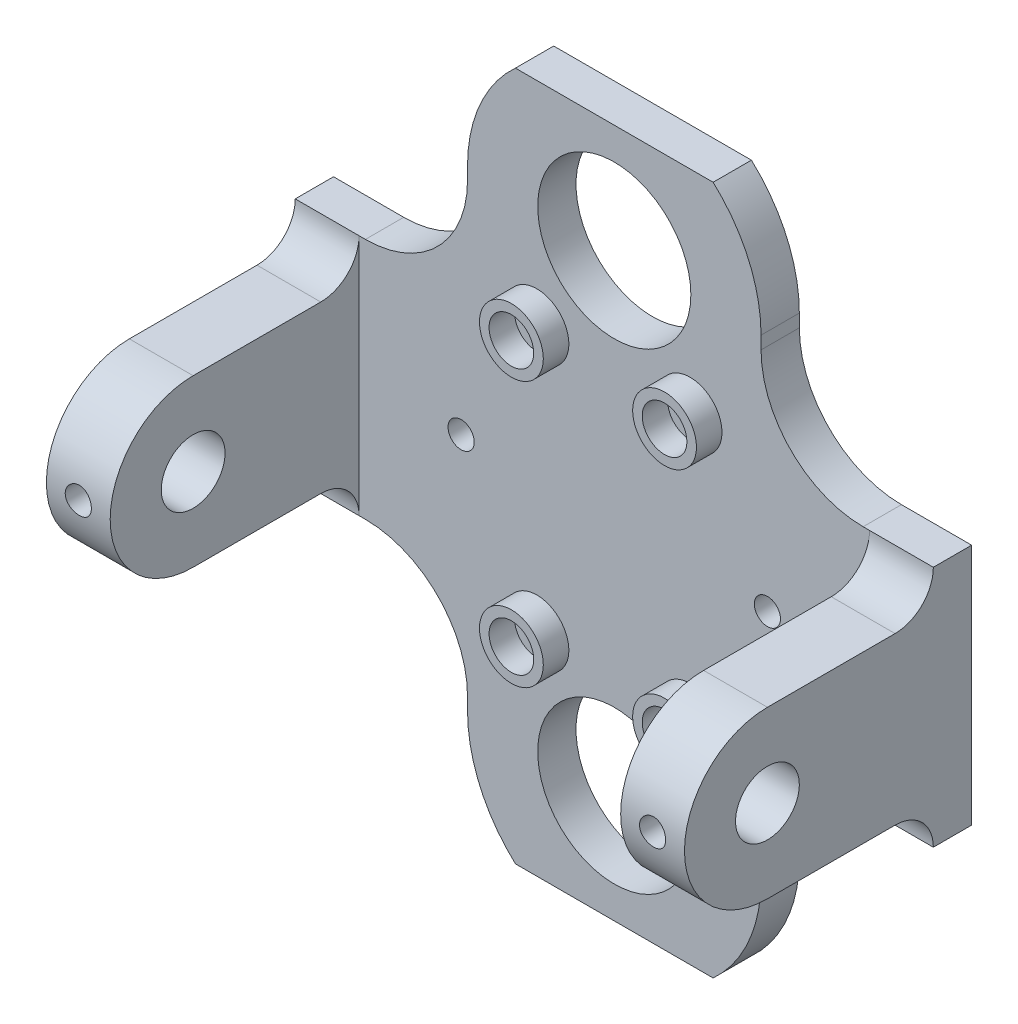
ISO-10303-21;
HEADER;
FILE_DESCRIPTION(('STEP AP214'),'2;1');
FILE_NAME('part.step','',(''),(''),'','','');
FILE_SCHEMA(('AUTOMOTIVE_DESIGN { 1 0 10303 214 1 1 1 1 }'));
ENDSEC;
DATA;
#1=APPLICATION_CONTEXT('core data for automotive mechanical design processes');
#2=APPLICATION_PROTOCOL_DEFINITION('international standard','automotive_design',2000,#1);
#3=PRODUCT_CONTEXT('',#1,'mechanical');
#4=PRODUCT('Part','Part','',(#3));
#5=PRODUCT_RELATED_PRODUCT_CATEGORY('part','',(#4));
#6=PRODUCT_DEFINITION_FORMATION('','',#4);
#7=PRODUCT_DEFINITION_CONTEXT('part definition',#1,'design');
#8=PRODUCT_DEFINITION('design','',#6,#7);
#9=PRODUCT_DEFINITION_SHAPE('','',#8);
#10=(LENGTH_UNIT() NAMED_UNIT(*) SI_UNIT(.MILLI.,.METRE.));
#11=(NAMED_UNIT(*) PLANE_ANGLE_UNIT() SI_UNIT($,.RADIAN.));
#12=(NAMED_UNIT(*) SI_UNIT($,.STERADIAN.) SOLID_ANGLE_UNIT());
#13=UNCERTAINTY_MEASURE_WITH_UNIT(LENGTH_MEASURE(1.E-05),#10,'distance_accuracy_value','');
#14=(GEOMETRIC_REPRESENTATION_CONTEXT(3) GLOBAL_UNCERTAINTY_ASSIGNED_CONTEXT((#13)) GLOBAL_UNIT_ASSIGNED_CONTEXT((#10,
#11,#12)) REPRESENTATION_CONTEXT('',''));
#15=CARTESIAN_POINT('',(0.,0.,0.));
#16=DIRECTION('',(0.,0.,1.));
#17=DIRECTION('',(1.,0.,0.));
#18=AXIS2_PLACEMENT_3D('',#15,#16,#17);
#19=CARTESIAN_POINT('',(-11.5,0.,3.));
#20=DIRECTION('',(0.,0.,-1.));
#21=DIRECTION('',(-1.,0.,0.));
#22=AXIS2_PLACEMENT_3D('',#19,#20,#21);
#23=PLANE('',#22);
#24=CARTESIAN_POINT('',(0.499999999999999,18.5,3.));
#25=DIRECTION('',(0.,0.,1.));
#26=DIRECTION('',(1.,0.,0.));
#27=AXIS2_PLACEMENT_3D('',#24,#25,#26);
#28=CIRCLE('',#27,1.02499999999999);
#29=CARTESIAN_POINT('',(1.52499999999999,18.5,3.));
#30=VERTEX_POINT('',#29);
#31=EDGE_CURVE('E405',#30,#30,#28,.T.);
#32=ORIENTED_EDGE('',*,*,#31,.F.);
#33=EDGE_LOOP('',(#32));
#34=FACE_BOUND('',#33,.T.);
#35=CARTESIAN_POINT('',(-23.5,18.4999999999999,3.));
#36=DIRECTION('',(0.,0.,1.));
#37=DIRECTION('',(1.,0.,0.));
#38=AXIS2_PLACEMENT_3D('',#35,#36,#37);
#39=CIRCLE('',#38,1.02499999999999);
#40=CARTESIAN_POINT('',(-22.475,18.4999999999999,3.));
#41=VERTEX_POINT('',#40);
#42=EDGE_CURVE('E396',#41,#41,#39,.T.);
#43=ORIENTED_EDGE('',*,*,#42,.F.);
#44=EDGE_LOOP('',(#43));
#45=FACE_BOUND('',#44,.T.);
#46=CARTESIAN_POINT('',(-11.5,37.,3.));
#47=DIRECTION('',(0.,0.,1.));
#48=DIRECTION('',(1.,0.,0.));
#49=AXIS2_PLACEMENT_3D('',#46,#47,#48);
#50=CIRCLE('',#49,6.);
#51=CARTESIAN_POINT('',(-5.5,37.,3.));
#52=VERTEX_POINT('',#51);
#53=EDGE_CURVE('E791',#52,#52,#50,.T.);
#54=ORIENTED_EDGE('',*,*,#53,.F.);
#55=EDGE_LOOP('',(#54));
#56=FACE_BOUND('',#55,.T.);
#57=CARTESIAN_POINT('',(-11.5,0.,3.));
#58=DIRECTION('',(0.,0.,1.));
#59=DIRECTION('',(1.,0.,0.));
#60=AXIS2_PLACEMENT_3D('',#57,#58,#59);
#61=CIRCLE('',#60,6.);
#62=CARTESIAN_POINT('',(-5.5,0.,3.));
#63=VERTEX_POINT('',#62);
#64=EDGE_CURVE('E784',#63,#63,#61,.T.);
#65=ORIENTED_EDGE('',*,*,#64,.F.);
#66=EDGE_LOOP('',(#65));
#67=FACE_BOUND('',#66,.T.);
#68=DIRECTION('',(-1.,0.,0.));
#69=VECTOR('',#68,1.);
#70=CARTESIAN_POINT('',(-36.5,28.,3.));
#71=LINE('',#70,#69);
#72=CARTESIAN_POINT('',(-31.0000000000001,28.,3.));
#73=VERTEX_POINT('',#72);
#74=CARTESIAN_POINT('',(-31.5,28.,3.));
#75=VERTEX_POINT('',#74);
#76=EDGE_CURVE('E482',#73,#75,#71,.T.);
#77=ORIENTED_EDGE('',*,*,#76,.T.);
#78=DIRECTION('',(0.,1.,0.));
#79=VECTOR('',#78,1.);
#80=CARTESIAN_POINT('',(-31.5,12.,3.));
#81=LINE('',#80,#79);
#82=CARTESIAN_POINT('',(-31.5,9.,3.));
#83=VERTEX_POINT('',#82);
#84=EDGE_CURVE('E824',#83,#75,#81,.T.);
#85=ORIENTED_EDGE('',*,*,#84,.F.);
#86=DIRECTION('',(1.,0.,0.));
#87=VECTOR('',#86,1.);
#88=CARTESIAN_POINT('',(-36.5,9.,3.));
#89=LINE('',#88,#87);
#90=CARTESIAN_POINT('',(-31.0000000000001,9.,3.));
#91=VERTEX_POINT('',#90);
#92=EDGE_CURVE('E485',#83,#91,#89,.T.);
#93=ORIENTED_EDGE('',*,*,#92,.T.);
#94=CARTESIAN_POINT('',(-31.,0.999999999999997,3.));
#95=DIRECTION('',(0.,0.,-1.));
#96=DIRECTION('',(-1.,0.,0.));
#97=AXIS2_PLACEMENT_3D('',#94,#95,#96);
#98=CIRCLE('',#97,8.);
#99=CARTESIAN_POINT('',(-23.,0.999999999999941,3.));
#100=VERTEX_POINT('',#99);
#101=EDGE_CURVE('E489',#91,#100,#98,.T.);
#102=ORIENTED_EDGE('',*,*,#101,.T.);
#103=DIRECTION('',(0.,-1.,0.));
#104=VECTOR('',#103,1.);
#105=CARTESIAN_POINT('',(-23.,0.,3.));
#106=LINE('',#105,#104);
#107=CARTESIAN_POINT('',(-23.,0.,3.));
#108=VERTEX_POINT('',#107);
#109=EDGE_CURVE('E491',#100,#108,#106,.T.);
#110=ORIENTED_EDGE('',*,*,#109,.T.);
#111=CARTESIAN_POINT('',(-11.5,0.,3.));
#112=DIRECTION('',(0.,0.,1.));
#113=DIRECTION('',(-1.,0.,0.));
#114=AXIS2_PLACEMENT_3D('',#111,#112,#113);
#115=CIRCLE('',#114,11.5);
#116=CARTESIAN_POINT('',(-19.2459666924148,-8.50000000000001,3.));
#117=VERTEX_POINT('',#116);
#118=EDGE_CURVE('E493',#108,#117,#115,.T.);
#119=ORIENTED_EDGE('',*,*,#118,.T.);
#120=DIRECTION('',(1.,0.,0.));
#121=VECTOR('',#120,1.);
#122=CARTESIAN_POINT('',(-19.2459666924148,-8.5,3.));
#123=LINE('',#122,#121);
#124=CARTESIAN_POINT('',(-3.75403330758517,-8.5,3.));
#125=VERTEX_POINT('',#124);
#126=EDGE_CURVE('E495',#117,#125,#123,.T.);
#127=ORIENTED_EDGE('',*,*,#126,.T.);
#128=CARTESIAN_POINT('',(-11.5,0.,3.));
#129=DIRECTION('',(0.,0.,1.));
#130=DIRECTION('',(-1.,0.,0.));
#131=AXIS2_PLACEMENT_3D('',#128,#129,#130);
#132=CIRCLE('',#131,11.5);
#133=CARTESIAN_POINT('',(0.,0.,3.));
#134=VERTEX_POINT('',#133);
#135=EDGE_CURVE('E452',#125,#134,#132,.T.);
#136=ORIENTED_EDGE('',*,*,#135,.T.);
#137=DIRECTION('',(0.,1.,0.));
#138=VECTOR('',#137,1.);
#139=CARTESIAN_POINT('',(0.,0.,3.));
#140=LINE('',#139,#138);
#141=CARTESIAN_POINT('',(0.,0.999999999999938,3.));
#142=VERTEX_POINT('',#141);
#143=EDGE_CURVE('E455',#134,#142,#140,.T.);
#144=ORIENTED_EDGE('',*,*,#143,.T.);
#145=CARTESIAN_POINT('',(8.,0.999999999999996,3.));
#146=DIRECTION('',(0.,0.,-1.));
#147=DIRECTION('',(-1.,0.,0.));
#148=AXIS2_PLACEMENT_3D('',#145,#146,#147);
#149=CIRCLE('',#148,8.);
#150=CARTESIAN_POINT('',(8.00000000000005,8.99999999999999,3.));
#151=VERTEX_POINT('',#150);
#152=EDGE_CURVE('E457',#142,#151,#149,.T.);
#153=ORIENTED_EDGE('',*,*,#152,.T.);
#154=DIRECTION('',(1.,0.,0.));
#155=VECTOR('',#154,1.);
#156=CARTESIAN_POINT('',(8.00000000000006,8.99999999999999,3.));
#157=LINE('',#156,#155);
#158=CARTESIAN_POINT('',(8.5,8.99999999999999,3.));
#159=VERTEX_POINT('',#158);
#160=EDGE_CURVE('E460',#151,#159,#157,.T.);
#161=ORIENTED_EDGE('',*,*,#160,.T.);
#162=DIRECTION('',(0.,1.,0.));
#163=VECTOR('',#162,1.);
#164=CARTESIAN_POINT('',(8.5,12.,3.));
#165=LINE('',#164,#163);
#166=CARTESIAN_POINT('',(8.5,28.,3.));
#167=VERTEX_POINT('',#166);
#168=EDGE_CURVE('E892',#159,#167,#165,.T.);
#169=ORIENTED_EDGE('',*,*,#168,.T.);
#170=DIRECTION('',(-1.,0.,0.));
#171=VECTOR('',#170,1.);
#172=CARTESIAN_POINT('',(8.00000000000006,28.,3.));
#173=LINE('',#172,#171);
#174=CARTESIAN_POINT('',(8.00000000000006,28.,3.));
#175=VERTEX_POINT('',#174);
#176=EDGE_CURVE('E463',#167,#175,#173,.T.);
#177=ORIENTED_EDGE('',*,*,#176,.T.);
#178=CARTESIAN_POINT('',(8.,36.,3.));
#179=DIRECTION('',(0.,0.,-1.));
#180=DIRECTION('',(-1.,0.,0.));
#181=AXIS2_PLACEMENT_3D('',#178,#179,#180);
#182=CIRCLE('',#181,8.);
#183=CARTESIAN_POINT('',(0.,36.,3.));
#184=VERTEX_POINT('',#183);
#185=EDGE_CURVE('E467',#175,#184,#182,.T.);
#186=ORIENTED_EDGE('',*,*,#185,.T.);
#187=DIRECTION('',(0.,1.,0.));
#188=VECTOR('',#187,1.);
#189=CARTESIAN_POINT('',(0.,36.,3.));
#190=LINE('',#189,#188);
#191=CARTESIAN_POINT('',(0.,37.,3.));
#192=VERTEX_POINT('',#191);
#193=EDGE_CURVE('E469',#184,#192,#190,.T.);
#194=ORIENTED_EDGE('',*,*,#193,.T.);
#195=CARTESIAN_POINT('',(-11.5,37.,3.));
#196=DIRECTION('',(0.,0.,1.));
#197=DIRECTION('',(-1.,0.,0.));
#198=AXIS2_PLACEMENT_3D('',#195,#196,#197);
#199=CIRCLE('',#198,11.5);
#200=CARTESIAN_POINT('',(-3.75403330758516,45.5,3.));
#201=VERTEX_POINT('',#200);
#202=EDGE_CURVE('E471',#192,#201,#199,.T.);
#203=ORIENTED_EDGE('',*,*,#202,.T.);
#204=DIRECTION('',(-1.,0.,0.));
#205=VECTOR('',#204,1.);
#206=CARTESIAN_POINT('',(-19.2459666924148,45.5,3.));
#207=LINE('',#206,#205);
#208=CARTESIAN_POINT('',(-19.2459666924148,45.5,3.));
#209=VERTEX_POINT('',#208);
#210=EDGE_CURVE('E473',#201,#209,#207,.T.);
#211=ORIENTED_EDGE('',*,*,#210,.T.);
#212=CARTESIAN_POINT('',(-11.5,37.,3.));
#213=DIRECTION('',(0.,0.,1.));
#214=DIRECTION('',(-1.,0.,0.));
#215=AXIS2_PLACEMENT_3D('',#212,#213,#214);
#216=CIRCLE('',#215,11.5);
#217=CARTESIAN_POINT('',(-23.,37.,3.));
#218=VERTEX_POINT('',#217);
#219=EDGE_CURVE('E475',#209,#218,#216,.T.);
#220=ORIENTED_EDGE('',*,*,#219,.T.);
#221=DIRECTION('',(0.,-1.,0.));
#222=VECTOR('',#221,1.);
#223=CARTESIAN_POINT('',(-23.,36.,3.));
#224=LINE('',#223,#222);
#225=CARTESIAN_POINT('',(-23.,36.,3.));
#226=VERTEX_POINT('',#225);
#227=EDGE_CURVE('E477',#218,#226,#224,.T.);
#228=ORIENTED_EDGE('',*,*,#227,.T.);
#229=CARTESIAN_POINT('',(-31.,36.,3.));
#230=DIRECTION('',(0.,0.,-1.));
#231=DIRECTION('',(1.,0.,0.));
#232=AXIS2_PLACEMENT_3D('',#229,#230,#231);
#233=CIRCLE('',#232,8.);
#234=EDGE_CURVE('E479',#226,#73,#233,.T.);
#235=ORIENTED_EDGE('',*,*,#234,.T.);
#236=EDGE_LOOP('',(#77,#85,#93,#102,#110,#119,#127,#136,#144,#153,#161,#169,#177,#186,#194,#203,
#211,#220,#228,#235));
#237=FACE_BOUND('',#236,.T.);
#238=CARTESIAN_POINT('',(-5.56204098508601,8.08579421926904,3.));
#239=DIRECTION('',(0.,0.,-1.));
#240=DIRECTION('',(-1.,0.,0.));
#241=AXIS2_PLACEMENT_3D('',#238,#239,#240);
#242=CIRCLE('',#241,2.5);
#243=CARTESIAN_POINT('',(-8.06204098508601,8.08579421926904,3.));
#244=VERTEX_POINT('',#243);
#245=EDGE_CURVE('E276',#244,#244,#242,.F.);
#246=ORIENTED_EDGE('',*,*,#245,.F.);
#247=EDGE_LOOP('',(#246));
#248=FACE_BOUND('',#247,.T.);
#249=CARTESIAN_POINT('',(-17.562040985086,8.08579421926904,3.));
#250=DIRECTION('',(0.,0.,-1.));
#251=DIRECTION('',(-1.,0.,0.));
#252=AXIS2_PLACEMENT_3D('',#249,#250,#251);
#253=CIRCLE('',#252,2.5);
#254=CARTESIAN_POINT('',(-20.062040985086,8.08579421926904,3.));
#255=VERTEX_POINT('',#254);
#256=EDGE_CURVE('E279',#255,#255,#253,.F.);
#257=ORIENTED_EDGE('',*,*,#256,.F.);
#258=EDGE_LOOP('',(#257));
#259=FACE_BOUND('',#258,.T.);
#260=CARTESIAN_POINT('',(-5.56204098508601,28.865794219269,3.));
#261=DIRECTION('',(0.,0.,-1.));
#262=DIRECTION('',(-1.,0.,0.));
#263=AXIS2_PLACEMENT_3D('',#260,#261,#262);
#264=CIRCLE('',#263,2.5);
#265=CARTESIAN_POINT('',(-8.06204098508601,28.865794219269,3.));
#266=VERTEX_POINT('',#265);
#267=EDGE_CURVE('E36',#266,#266,#264,.F.);
#268=ORIENTED_EDGE('',*,*,#267,.F.);
#269=EDGE_LOOP('',(#268));
#270=FACE_BOUND('',#269,.T.);
#271=CARTESIAN_POINT('',(-17.562040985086,28.865794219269,3.));
#272=DIRECTION('',(0.,0.,-1.));
#273=DIRECTION('',(-1.,0.,0.));
#274=AXIS2_PLACEMENT_3D('',#271,#272,#273);
#275=CIRCLE('',#274,2.5);
#276=CARTESIAN_POINT('',(-20.062040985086,28.865794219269,3.));
#277=VERTEX_POINT('',#276);
#278=EDGE_CURVE('E11',#277,#277,#275,.F.);
#279=ORIENTED_EDGE('',*,*,#278,.F.);
#280=EDGE_LOOP('',(#279));
#281=FACE_BOUND('',#280,.T.);
#282=ADVANCED_FACE('F28',(#34,#45,#56,#67,#237,#248,#259,#270,#281),#23,.F.);
#283=CARTESIAN_POINT('',(-17.562040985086,28.865794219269,3.));
#284=DIRECTION('',(0.,0.,1.));
#285=DIRECTION('',(1.,0.,0.));
#286=AXIS2_PLACEMENT_3D('',#283,#284,#285);
#287=CIRCLE('',#286,1.75);
#288=CARTESIAN_POINT('',(-15.812040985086,28.865794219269,3.));
#289=VERTEX_POINT('',#288);
#290=EDGE_CURVE('E377',#289,#289,#287,.T.);
#291=ORIENTED_EDGE('',*,*,#290,.T.);
#292=EDGE_LOOP('',(#291));
#293=FACE_BOUND('',#292,.T.);
#294=CARTESIAN_POINT('',(-17.5,28.8923048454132,3.));
#295=DIRECTION('',(0.,0.,1.));
#296=DIRECTION('',(1.,0.,0.));
#297=AXIS2_PLACEMENT_3D('',#294,#295,#296);
#298=CIRCLE('',#297,1.02499999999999);
#299=CARTESIAN_POINT('',(-16.475,28.8923048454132,3.));
#300=VERTEX_POINT('',#299);
#301=EDGE_CURVE('E387',#300,#300,#298,.T.);
#302=ORIENTED_EDGE('',*,*,#301,.F.);
#303=EDGE_LOOP('',(#302));
#304=FACE_BOUND('',#303,.T.);
#305=ADVANCED_FACE('F288',(#293,#304),#23,.F.);
#306=CARTESIAN_POINT('',(-5.56204098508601,28.865794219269,3.));
#307=DIRECTION('',(0.,0.,1.));
#308=DIRECTION('',(1.,0.,0.));
#309=AXIS2_PLACEMENT_3D('',#306,#307,#308);
#310=CIRCLE('',#309,1.75);
#311=CARTESIAN_POINT('',(-3.81204098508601,28.865794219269,3.));
#312=VERTEX_POINT('',#311);
#313=EDGE_CURVE('E368',#312,#312,#310,.T.);
#314=ORIENTED_EDGE('',*,*,#313,.T.);
#315=EDGE_LOOP('',(#314));
#316=FACE_BOUND('',#315,.T.);
#317=CARTESIAN_POINT('',(-5.50000000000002,28.8923048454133,3.));
#318=DIRECTION('',(0.,0.,1.));
#319=DIRECTION('',(1.,0.,0.));
#320=AXIS2_PLACEMENT_3D('',#317,#318,#319);
#321=CIRCLE('',#320,1.02499999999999);
#322=CARTESIAN_POINT('',(-4.47500000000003,28.8923048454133,3.));
#323=VERTEX_POINT('',#322);
#324=EDGE_CURVE('E393',#323,#323,#321,.T.);
#325=ORIENTED_EDGE('',*,*,#324,.F.);
#326=EDGE_LOOP('',(#325));
#327=FACE_BOUND('',#326,.T.);
#328=ADVANCED_FACE('F384',(#316,#327),#23,.F.);
#329=CARTESIAN_POINT('',(-17.562040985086,8.08579421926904,3.));
#330=DIRECTION('',(0.,0.,1.));
#331=DIRECTION('',(1.,0.,0.));
#332=AXIS2_PLACEMENT_3D('',#329,#330,#331);
#333=CIRCLE('',#332,1.75);
#334=CARTESIAN_POINT('',(-15.812040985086,8.08579421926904,3.));
#335=VERTEX_POINT('',#334);
#336=EDGE_CURVE('E359',#335,#335,#333,.T.);
#337=ORIENTED_EDGE('',*,*,#336,.T.);
#338=EDGE_LOOP('',(#337));
#339=FACE_BOUND('',#338,.T.);
#340=CARTESIAN_POINT('',(-17.4999999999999,8.10769515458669,3.));
#341=DIRECTION('',(0.,0.,1.));
#342=DIRECTION('',(1.,0.,0.));
#343=AXIS2_PLACEMENT_3D('',#340,#341,#342);
#344=CIRCLE('',#343,1.02499999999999);
#345=CARTESIAN_POINT('',(-16.4749999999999,8.10769515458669,3.));
#346=VERTEX_POINT('',#345);
#347=EDGE_CURVE('E803',#346,#346,#344,.T.);
#348=ORIENTED_EDGE('',*,*,#347,.F.);
#349=EDGE_LOOP('',(#348));
#350=FACE_BOUND('',#349,.T.);
#351=ADVANCED_FACE('F665',(#339,#350),#23,.F.);
#352=CARTESIAN_POINT('',(-5.56204098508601,8.08579421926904,3.));
#353=DIRECTION('',(0.,0.,1.));
#354=DIRECTION('',(1.,0.,0.));
#355=AXIS2_PLACEMENT_3D('',#352,#353,#354);
#356=CIRCLE('',#355,1.75);
#357=CARTESIAN_POINT('',(-3.81204098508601,8.08579421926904,3.));
#358=VERTEX_POINT('',#357);
#359=EDGE_CURVE('E349',#358,#358,#356,.T.);
#360=ORIENTED_EDGE('',*,*,#359,.T.);
#361=EDGE_LOOP('',(#360));
#362=FACE_BOUND('',#361,.T.);
#363=CARTESIAN_POINT('',(-5.49999999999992,8.10769515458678,3.));
#364=DIRECTION('',(0.,0.,1.));
#365=DIRECTION('',(1.,0.,0.));
#366=AXIS2_PLACEMENT_3D('',#363,#364,#365);
#367=CIRCLE('',#366,1.02499999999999);
#368=CARTESIAN_POINT('',(-4.47499999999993,8.10769515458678,3.));
#369=VERTEX_POINT('',#368);
#370=EDGE_CURVE('E797',#369,#369,#367,.T.);
#371=ORIENTED_EDGE('',*,*,#370,.F.);
#372=EDGE_LOOP('',(#371));
#373=FACE_BOUND('',#372,.T.);
#374=ADVANCED_FACE('F291',(#362,#373),#23,.F.);
#375=CARTESIAN_POINT('',(-11.5,0.,3.));
#376=DIRECTION('',(0.,0.,-1.));
#377=DIRECTION('',(-1.,0.,0.));
#378=AXIS2_PLACEMENT_3D('',#375,#376,#377);
#379=CYLINDRICAL_SURFACE('',#378,11.5);
#380=CARTESIAN_POINT('',(-11.5,0.,0.));
#381=DIRECTION('',(0.,0.,1.));
#382=DIRECTION('',(-1.,0.,0.));
#383=AXIS2_PLACEMENT_3D('',#380,#381,#382);
#384=CIRCLE('',#383,11.5);
#385=CARTESIAN_POINT('',(-3.75403330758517,-8.5,0.));
#386=VERTEX_POINT('',#385);
#387=CARTESIAN_POINT('',(0.,0.,0.));
#388=VERTEX_POINT('',#387);
#389=EDGE_CURVE('E411',#386,#388,#384,.T.);
#390=ORIENTED_EDGE('',*,*,#389,.T.);
#391=DIRECTION('',(0.,0.,-1.));
#392=VECTOR('',#391,1.);
#393=CARTESIAN_POINT('',(0.,0.,3.));
#394=LINE('',#393,#392);
#395=EDGE_CURVE('E554',#134,#388,#394,.T.);
#396=ORIENTED_EDGE('',*,*,#395,.F.);
#397=ORIENTED_EDGE('',*,*,#135,.F.);
#398=DIRECTION('',(0.,0.,-1.));
#399=VECTOR('',#398,1.);
#400=CARTESIAN_POINT('',(-3.75403330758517,-8.5,3.));
#401=LINE('',#400,#399);
#402=EDGE_CURVE('E497',#125,#386,#401,.T.);
#403=ORIENTED_EDGE('',*,*,#402,.T.);
#404=EDGE_LOOP('',(#390,#396,#397,#403));
#405=FACE_BOUND('',#404,.T.);
#406=ADVANCED_FACE('F30',(#405),#379,.T.);
#407=CARTESIAN_POINT('',(0.,0.,3.));
#408=DIRECTION('',(-1.,0.,0.));
#409=DIRECTION('',(0.,-1.,0.));
#410=AXIS2_PLACEMENT_3D('',#407,#408,#409);
#411=PLANE('',#410);
#412=DIRECTION('',(0.,1.,0.));
#413=VECTOR('',#412,1.);
#414=CARTESIAN_POINT('',(0.,0.,0.));
#415=LINE('',#414,#413);
#416=CARTESIAN_POINT('',(0.,0.999999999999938,0.));
#417=VERTEX_POINT('',#416);
#418=EDGE_CURVE('E414',#388,#417,#415,.T.);
#419=ORIENTED_EDGE('',*,*,#418,.T.);
#420=DIRECTION('',(0.,0.,-1.));
#421=VECTOR('',#420,1.);
#422=CARTESIAN_POINT('',(0.,0.999999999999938,3.));
#423=LINE('',#422,#421);
#424=EDGE_CURVE('E551',#142,#417,#423,.T.);
#425=ORIENTED_EDGE('',*,*,#424,.F.);
#426=ORIENTED_EDGE('',*,*,#143,.F.);
#427=ORIENTED_EDGE('',*,*,#395,.T.);
#428=EDGE_LOOP('',(#419,#425,#426,#427));
#429=FACE_BOUND('',#428,.T.);
#430=ADVANCED_FACE('F736',(#429),#411,.F.);
#431=CARTESIAN_POINT('',(8.,0.999999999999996,3.));
#432=DIRECTION('',(0.,0.,-1.));
#433=DIRECTION('',(-1.,0.,0.));
#434=AXIS2_PLACEMENT_3D('',#431,#432,#433);
#435=CYLINDRICAL_SURFACE('',#434,8.);
#436=CARTESIAN_POINT('',(8.,0.999999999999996,0.));
#437=DIRECTION('',(0.,0.,-1.));
#438=DIRECTION('',(-1.,0.,0.));
#439=AXIS2_PLACEMENT_3D('',#436,#437,#438);
#440=CIRCLE('',#439,8.);
#441=CARTESIAN_POINT('',(8.00000000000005,8.99999999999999,0.));
#442=VERTEX_POINT('',#441);
#443=EDGE_CURVE('E416',#417,#442,#440,.T.);
#444=ORIENTED_EDGE('',*,*,#443,.T.);
#445=DIRECTION('',(0.,0.,-1.));
#446=VECTOR('',#445,1.);
#447=CARTESIAN_POINT('',(8.00000000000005,8.99999999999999,3.));
#448=LINE('',#447,#446);
#449=EDGE_CURVE('E548',#151,#442,#448,.T.);
#450=ORIENTED_EDGE('',*,*,#449,.F.);
#451=ORIENTED_EDGE('',*,*,#152,.F.);
#452=ORIENTED_EDGE('',*,*,#424,.T.);
#453=EDGE_LOOP('',(#444,#450,#451,#452));
#454=FACE_BOUND('',#453,.T.);
#455=ADVANCED_FACE('F733',(#454),#435,.F.);
#456=CARTESIAN_POINT('',(8.00000000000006,8.99999999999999,3.));
#457=DIRECTION('',(0.,1.,0.));
#458=DIRECTION('',(0.,0.,1.));
#459=AXIS2_PLACEMENT_3D('',#456,#457,#458);
#460=PLANE('',#459);
#461=DIRECTION('',(1.,0.,0.));
#462=VECTOR('',#461,1.);
#463=CARTESIAN_POINT('',(8.00000000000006,8.99999999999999,0.));
#464=LINE('',#463,#462);
#465=CARTESIAN_POINT('',(13.5,8.99999999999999,0.));
#466=VERTEX_POINT('',#465);
#467=EDGE_CURVE('E418',#442,#466,#464,.T.);
#468=ORIENTED_EDGE('',*,*,#467,.T.);
#469=DIRECTION('',(0.,0.,-1.));
#470=VECTOR('',#469,1.);
#471=CARTESIAN_POINT('',(13.5,8.99999999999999,3.));
#472=LINE('',#471,#470);
#473=CARTESIAN_POINT('',(13.5,8.99999999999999,3.));
#474=VERTEX_POINT('',#473);
#475=EDGE_CURVE('E545',#474,#466,#472,.T.);
#476=ORIENTED_EDGE('',*,*,#475,.F.);
#477=EDGE_CURVE('E459',#159,#474,#157,.T.);
#478=ORIENTED_EDGE('',*,*,#477,.F.);
#479=ORIENTED_EDGE('',*,*,#160,.F.);
#480=ORIENTED_EDGE('',*,*,#449,.T.);
#481=EDGE_LOOP('',(#468,#476,#478,#479,#480));
#482=FACE_BOUND('',#481,.T.);
#483=ADVANCED_FACE('F729',(#482),#460,.F.);
#484=CARTESIAN_POINT('',(13.5,28.,3.));
#485=DIRECTION('',(-1.,0.,0.));
#486=DIRECTION('',(0.,-1.,0.));
#487=AXIS2_PLACEMENT_3D('',#484,#485,#486);
#488=PLANE('',#487);
#489=CARTESIAN_POINT('',(13.5,18.5,16.));
#490=DIRECTION('',(1.,0.,0.));
#491=DIRECTION('',(0.,1.,0.));
#492=AXIS2_PLACEMENT_3D('',#489,#490,#491);
#493=CIRCLE('',#492,2.5);
#494=CARTESIAN_POINT('',(13.5,21.,16.));
#495=VERTEX_POINT('',#494);
#496=EDGE_CURVE('E584',#495,#495,#493,.T.);
#497=ORIENTED_EDGE('',*,*,#496,.F.);
#498=EDGE_LOOP('',(#497));
#499=FACE_BOUND('',#498,.T.);
#500=DIRECTION('',(0.,1.,0.));
#501=VECTOR('',#500,1.);
#502=CARTESIAN_POINT('',(13.5,28.,0.));
#503=LINE('',#502,#501);
#504=CARTESIAN_POINT('',(13.5,28.,0.));
#505=VERTEX_POINT('',#504);
#506=EDGE_CURVE('E420',#466,#505,#503,.T.);
#507=ORIENTED_EDGE('',*,*,#506,.T.);
#508=DIRECTION('',(0.,0.,-1.));
#509=VECTOR('',#508,1.);
#510=CARTESIAN_POINT('',(13.5,28.,3.));
#511=LINE('',#510,#509);
#512=CARTESIAN_POINT('',(13.5,28.,3.));
#513=VERTEX_POINT('',#512);
#514=EDGE_CURVE('E542',#513,#505,#511,.T.);
#515=ORIENTED_EDGE('',*,*,#514,.F.);
#516=CARTESIAN_POINT('',(13.5,28.,6.));
#517=DIRECTION('',(-1.,0.,0.));
#518=DIRECTION('',(0.,-1.,0.));
#519=AXIS2_PLACEMENT_3D('',#516,#517,#518);
#520=CIRCLE('',#519,3.);
#521=CARTESIAN_POINT('',(13.5,25.,6.));
#522=VERTEX_POINT('',#521);
#523=EDGE_CURVE('E572',#513,#522,#520,.T.);
#524=ORIENTED_EDGE('',*,*,#523,.T.);
#525=DIRECTION('',(0.,0.,1.));
#526=VECTOR('',#525,1.);
#527=CARTESIAN_POINT('',(13.5,25.,3.));
#528=LINE('',#527,#526);
#529=CARTESIAN_POINT('',(13.5,25.,16.));
#530=VERTEX_POINT('',#529);
#531=EDGE_CURVE('E563',#522,#530,#528,.T.);
#532=ORIENTED_EDGE('',*,*,#531,.T.);
#533=CARTESIAN_POINT('',(13.5,18.5,16.));
#534=DIRECTION('',(1.,0.,0.));
#535=DIRECTION('',(0.,-1.,0.));
#536=AXIS2_PLACEMENT_3D('',#533,#534,#535);
#537=CIRCLE('',#536,6.5);
#538=CARTESIAN_POINT('',(13.5,12.,16.));
#539=VERTEX_POINT('',#538);
#540=EDGE_CURVE('E565',#530,#539,#537,.T.);
#541=ORIENTED_EDGE('',*,*,#540,.T.);
#542=DIRECTION('',(0.,0.,-1.));
#543=VECTOR('',#542,1.);
#544=CARTESIAN_POINT('',(13.5,12.,3.));
#545=LINE('',#544,#543);
#546=CARTESIAN_POINT('',(13.5,12.,6.));
#547=VERTEX_POINT('',#546);
#548=EDGE_CURVE('E560',#539,#547,#545,.T.);
#549=ORIENTED_EDGE('',*,*,#548,.T.);
#550=CARTESIAN_POINT('',(13.5,9.,6.));
#551=DIRECTION('',(-1.,0.,0.));
#552=DIRECTION('',(0.,-1.,0.));
#553=AXIS2_PLACEMENT_3D('',#550,#551,#552);
#554=CIRCLE('',#553,3.);
#555=EDGE_CURVE('E577',#547,#474,#554,.T.);
#556=ORIENTED_EDGE('',*,*,#555,.T.);
#557=ORIENTED_EDGE('',*,*,#475,.T.);
#558=EDGE_LOOP('',(#507,#515,#524,#532,#541,#549,#556,#557));
#559=FACE_BOUND('',#558,.T.);
#560=ADVANCED_FACE('F725',(#499,#559),#488,.F.);
#561=CARTESIAN_POINT('',(8.00000000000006,28.,3.));
#562=DIRECTION('',(0.,-1.,0.));
#563=DIRECTION('',(0.,0.,-1.));
#564=AXIS2_PLACEMENT_3D('',#561,#562,#563);
#565=PLANE('',#564);
#566=DIRECTION('',(-1.,0.,0.));
#567=VECTOR('',#566,1.);
#568=CARTESIAN_POINT('',(8.00000000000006,28.,0.));
#569=LINE('',#568,#567);
#570=CARTESIAN_POINT('',(8.00000000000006,28.,0.));
#571=VERTEX_POINT('',#570);
#572=EDGE_CURVE('E422',#505,#571,#569,.T.);
#573=ORIENTED_EDGE('',*,*,#572,.T.);
#574=DIRECTION('',(0.,0.,-1.));
#575=VECTOR('',#574,1.);
#576=CARTESIAN_POINT('',(8.00000000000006,28.,3.));
#577=LINE('',#576,#575);
#578=EDGE_CURVE('E539',#175,#571,#577,.T.);
#579=ORIENTED_EDGE('',*,*,#578,.F.);
#580=ORIENTED_EDGE('',*,*,#176,.F.);
#581=EDGE_CURVE('E464',#513,#167,#173,.T.);
#582=ORIENTED_EDGE('',*,*,#581,.F.);
#583=ORIENTED_EDGE('',*,*,#514,.T.);
#584=EDGE_LOOP('',(#573,#579,#580,#582,#583));
#585=FACE_BOUND('',#584,.T.);
#586=ADVANCED_FACE('F721',(#585),#565,.F.);
#587=CARTESIAN_POINT('',(8.,36.,3.));
#588=DIRECTION('',(0.,0.,-1.));
#589=DIRECTION('',(-1.,0.,0.));
#590=AXIS2_PLACEMENT_3D('',#587,#588,#589);
#591=CYLINDRICAL_SURFACE('',#590,8.);
#592=CARTESIAN_POINT('',(8.,36.,0.));
#593=DIRECTION('',(0.,0.,-1.));
#594=DIRECTION('',(-1.,0.,0.));
#595=AXIS2_PLACEMENT_3D('',#592,#593,#594);
#596=CIRCLE('',#595,8.);
#597=CARTESIAN_POINT('',(0.,36.,0.));
#598=VERTEX_POINT('',#597);
#599=EDGE_CURVE('E424',#571,#598,#596,.T.);
#600=ORIENTED_EDGE('',*,*,#599,.T.);
#601=DIRECTION('',(0.,0.,-1.));
#602=VECTOR('',#601,1.);
#603=CARTESIAN_POINT('',(0.,36.,3.));
#604=LINE('',#603,#602);
#605=EDGE_CURVE('E536',#184,#598,#604,.T.);
#606=ORIENTED_EDGE('',*,*,#605,.F.);
#607=ORIENTED_EDGE('',*,*,#185,.F.);
#608=ORIENTED_EDGE('',*,*,#578,.T.);
#609=EDGE_LOOP('',(#600,#606,#607,#608));
#610=FACE_BOUND('',#609,.T.);
#611=ADVANCED_FACE('F717',(#610),#591,.F.);
#612=CARTESIAN_POINT('',(0.,36.,3.));
#613=DIRECTION('',(-1.,0.,0.));
#614=DIRECTION('',(0.,-1.,0.));
#615=AXIS2_PLACEMENT_3D('',#612,#613,#614);
#616=PLANE('',#615);
#617=DIRECTION('',(0.,1.,0.));
#618=VECTOR('',#617,1.);
#619=CARTESIAN_POINT('',(0.,36.,0.));
#620=LINE('',#619,#618);
#621=CARTESIAN_POINT('',(0.,37.,0.));
#622=VERTEX_POINT('',#621);
#623=EDGE_CURVE('E426',#598,#622,#620,.T.);
#624=ORIENTED_EDGE('',*,*,#623,.T.);
#625=DIRECTION('',(0.,0.,-1.));
#626=VECTOR('',#625,1.);
#627=CARTESIAN_POINT('',(0.,37.,3.));
#628=LINE('',#627,#626);
#629=EDGE_CURVE('E533',#192,#622,#628,.T.);
#630=ORIENTED_EDGE('',*,*,#629,.F.);
#631=ORIENTED_EDGE('',*,*,#193,.F.);
#632=ORIENTED_EDGE('',*,*,#605,.T.);
#633=EDGE_LOOP('',(#624,#630,#631,#632));
#634=FACE_BOUND('',#633,.T.);
#635=ADVANCED_FACE('F713',(#634),#616,.F.);
#636=CARTESIAN_POINT('',(-11.5,37.,3.));
#637=DIRECTION('',(0.,0.,-1.));
#638=DIRECTION('',(-1.,0.,0.));
#639=AXIS2_PLACEMENT_3D('',#636,#637,#638);
#640=CYLINDRICAL_SURFACE('',#639,11.5);
#641=CARTESIAN_POINT('',(-11.5,37.,0.));
#642=DIRECTION('',(0.,0.,1.));
#643=DIRECTION('',(-1.,0.,0.));
#644=AXIS2_PLACEMENT_3D('',#641,#642,#643);
#645=CIRCLE('',#644,11.5);
#646=CARTESIAN_POINT('',(-3.75403330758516,45.5,0.));
#647=VERTEX_POINT('',#646);
#648=EDGE_CURVE('E428',#622,#647,#645,.T.);
#649=ORIENTED_EDGE('',*,*,#648,.T.);
#650=DIRECTION('',(0.,0.,-1.));
#651=VECTOR('',#650,1.);
#652=CARTESIAN_POINT('',(-3.75403330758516,45.5,3.));
#653=LINE('',#652,#651);
#654=EDGE_CURVE('E530',#201,#647,#653,.T.);
#655=ORIENTED_EDGE('',*,*,#654,.F.);
#656=ORIENTED_EDGE('',*,*,#202,.F.);
#657=ORIENTED_EDGE('',*,*,#629,.T.);
#658=EDGE_LOOP('',(#649,#655,#656,#657));
#659=FACE_BOUND('',#658,.T.);
#660=ADVANCED_FACE('F709',(#659),#640,.T.);
#661=CARTESIAN_POINT('',(-19.2459666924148,45.5,3.));
#662=DIRECTION('',(0.,-1.,0.));
#663=DIRECTION('',(0.,0.,-1.));
#664=AXIS2_PLACEMENT_3D('',#661,#662,#663);
#665=PLANE('',#664);
#666=DIRECTION('',(-1.,0.,0.));
#667=VECTOR('',#666,1.);
#668=CARTESIAN_POINT('',(-19.2459666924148,45.5,0.));
#669=LINE('',#668,#667);
#670=CARTESIAN_POINT('',(-19.2459666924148,45.5,0.));
#671=VERTEX_POINT('',#670);
#672=EDGE_CURVE('E430',#647,#671,#669,.T.);
#673=ORIENTED_EDGE('',*,*,#672,.T.);
#674=DIRECTION('',(0.,0.,-1.));
#675=VECTOR('',#674,1.);
#676=CARTESIAN_POINT('',(-19.2459666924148,45.5,3.));
#677=LINE('',#676,#675);
#678=EDGE_CURVE('E527',#209,#671,#677,.T.);
#679=ORIENTED_EDGE('',*,*,#678,.F.);
#680=ORIENTED_EDGE('',*,*,#210,.F.);
#681=ORIENTED_EDGE('',*,*,#654,.T.);
#682=EDGE_LOOP('',(#673,#679,#680,#681));
#683=FACE_BOUND('',#682,.T.);
#684=ADVANCED_FACE('F705',(#683),#665,.F.);
#685=CARTESIAN_POINT('',(-11.5,37.,3.));
#686=DIRECTION('',(0.,0.,-1.));
#687=DIRECTION('',(-1.,0.,0.));
#688=AXIS2_PLACEMENT_3D('',#685,#686,#687);
#689=CYLINDRICAL_SURFACE('',#688,11.5);
#690=CARTESIAN_POINT('',(-11.5,37.,0.));
#691=DIRECTION('',(0.,0.,1.));
#692=DIRECTION('',(-1.,0.,0.));
#693=AXIS2_PLACEMENT_3D('',#690,#691,#692);
#694=CIRCLE('',#693,11.5);
#695=CARTESIAN_POINT('',(-23.,37.,0.));
#696=VERTEX_POINT('',#695);
#697=EDGE_CURVE('E432',#671,#696,#694,.T.);
#698=ORIENTED_EDGE('',*,*,#697,.T.);
#699=DIRECTION('',(0.,0.,-1.));
#700=VECTOR('',#699,1.);
#701=CARTESIAN_POINT('',(-23.,37.,3.));
#702=LINE('',#701,#700);
#703=EDGE_CURVE('E524',#218,#696,#702,.T.);
#704=ORIENTED_EDGE('',*,*,#703,.F.);
#705=ORIENTED_EDGE('',*,*,#219,.F.);
#706=ORIENTED_EDGE('',*,*,#678,.T.);
#707=EDGE_LOOP('',(#698,#704,#705,#706));
#708=FACE_BOUND('',#707,.T.);
#709=ADVANCED_FACE('F701',(#708),#689,.T.);
#710=CARTESIAN_POINT('',(-23.,36.,3.));
#711=DIRECTION('',(1.,0.,0.));
#712=DIRECTION('',(0.,0.,-1.));
#713=AXIS2_PLACEMENT_3D('',#710,#711,#712);
#714=PLANE('',#713);
#715=DIRECTION('',(0.,-1.,0.));
#716=VECTOR('',#715,1.);
#717=CARTESIAN_POINT('',(-23.,36.,0.));
#718=LINE('',#717,#716);
#719=CARTESIAN_POINT('',(-23.,36.,0.));
#720=VERTEX_POINT('',#719);
#721=EDGE_CURVE('E434',#696,#720,#718,.T.);
#722=ORIENTED_EDGE('',*,*,#721,.T.);
#723=DIRECTION('',(0.,0.,-1.));
#724=VECTOR('',#723,1.);
#725=CARTESIAN_POINT('',(-23.,36.,3.));
#726=LINE('',#725,#724);
#727=EDGE_CURVE('E521',#226,#720,#726,.T.);
#728=ORIENTED_EDGE('',*,*,#727,.F.);
#729=ORIENTED_EDGE('',*,*,#227,.F.);
#730=ORIENTED_EDGE('',*,*,#703,.T.);
#731=EDGE_LOOP('',(#722,#728,#729,#730));
#732=FACE_BOUND('',#731,.T.);
#733=ADVANCED_FACE('F697',(#732),#714,.F.);
#734=CARTESIAN_POINT('',(-31.,36.,3.));
#735=DIRECTION('',(0.,0.,-1.));
#736=DIRECTION('',(-1.,0.,0.));
#737=AXIS2_PLACEMENT_3D('',#734,#735,#736);
#738=CYLINDRICAL_SURFACE('',#737,8.);
#739=CARTESIAN_POINT('',(-31.,36.,0.));
#740=DIRECTION('',(0.,0.,-1.));
#741=DIRECTION('',(1.,0.,0.));
#742=AXIS2_PLACEMENT_3D('',#739,#740,#741);
#743=CIRCLE('',#742,8.);
#744=CARTESIAN_POINT('',(-31.0000000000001,28.,0.));
#745=VERTEX_POINT('',#744);
#746=EDGE_CURVE('E436',#720,#745,#743,.T.);
#747=ORIENTED_EDGE('',*,*,#746,.T.);
#748=DIRECTION('',(0.,0.,-1.));
#749=VECTOR('',#748,1.);
#750=CARTESIAN_POINT('',(-31.0000000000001,28.,3.));
#751=LINE('',#750,#749);
#752=EDGE_CURVE('E518',#73,#745,#751,.T.);
#753=ORIENTED_EDGE('',*,*,#752,.F.);
#754=ORIENTED_EDGE('',*,*,#234,.F.);
#755=ORIENTED_EDGE('',*,*,#727,.T.);
#756=EDGE_LOOP('',(#747,#753,#754,#755));
#757=FACE_BOUND('',#756,.T.);
#758=ADVANCED_FACE('F693',(#757),#738,.F.);
#759=CARTESIAN_POINT('',(-36.5,28.,3.));
#760=DIRECTION('',(0.,-1.,0.));
#761=DIRECTION('',(0.,0.,-1.));
#762=AXIS2_PLACEMENT_3D('',#759,#760,#761);
#763=PLANE('',#762);
#764=DIRECTION('',(-1.,0.,0.));
#765=VECTOR('',#764,1.);
#766=CARTESIAN_POINT('',(-36.5,28.,0.));
#767=LINE('',#766,#765);
#768=CARTESIAN_POINT('',(-36.5,28.,0.));
#769=VERTEX_POINT('',#768);
#770=EDGE_CURVE('E438',#745,#769,#767,.T.);
#771=ORIENTED_EDGE('',*,*,#770,.T.);
#772=DIRECTION('',(0.,0.,-1.));
#773=VECTOR('',#772,1.);
#774=CARTESIAN_POINT('',(-36.5,28.,3.));
#775=LINE('',#774,#773);
#776=CARTESIAN_POINT('',(-36.5,28.,3.));
#777=VERTEX_POINT('',#776);
#778=EDGE_CURVE('E515',#777,#769,#775,.T.);
#779=ORIENTED_EDGE('',*,*,#778,.F.);
#780=EDGE_CURVE('E481',#75,#777,#71,.T.);
#781=ORIENTED_EDGE('',*,*,#780,.F.);
#782=ORIENTED_EDGE('',*,*,#76,.F.);
#783=ORIENTED_EDGE('',*,*,#752,.T.);
#784=EDGE_LOOP('',(#771,#779,#781,#782,#783));
#785=FACE_BOUND('',#784,.T.);
#786=ADVANCED_FACE('F689',(#785),#763,.F.);
#787=CARTESIAN_POINT('',(-36.5,28.,3.));
#788=DIRECTION('',(1.,0.,0.));
#789=DIRECTION('',(0.,0.,-1.));
#790=AXIS2_PLACEMENT_3D('',#787,#788,#789);
#791=PLANE('',#790);
#792=CARTESIAN_POINT('',(-36.5,18.5,16.));
#793=DIRECTION('',(1.,0.,0.));
#794=DIRECTION('',(0.,1.,0.));
#795=AXIS2_PLACEMENT_3D('',#792,#793,#794);
#796=CIRCLE('',#795,2.5);
#797=CARTESIAN_POINT('',(-36.5,21.,16.));
#798=VERTEX_POINT('',#797);
#799=EDGE_CURVE('E245',#798,#798,#796,.T.);
#800=ORIENTED_EDGE('',*,*,#799,.T.);
#801=EDGE_LOOP('',(#800));
#802=FACE_BOUND('',#801,.T.);
#803=DIRECTION('',(0.,-1.,0.));
#804=VECTOR('',#803,1.);
#805=CARTESIAN_POINT('',(-36.5,28.,0.));
#806=LINE('',#805,#804);
#807=CARTESIAN_POINT('',(-36.5,9.,0.));
#808=VERTEX_POINT('',#807);
#809=EDGE_CURVE('E440',#769,#808,#806,.T.);
#810=ORIENTED_EDGE('',*,*,#809,.T.);
#811=DIRECTION('',(0.,0.,-1.));
#812=VECTOR('',#811,1.);
#813=CARTESIAN_POINT('',(-36.5,9.,3.));
#814=LINE('',#813,#812);
#815=CARTESIAN_POINT('',(-36.5,9.,3.));
#816=VERTEX_POINT('',#815);
#817=EDGE_CURVE('E512',#816,#808,#814,.T.);
#818=ORIENTED_EDGE('',*,*,#817,.F.);
#819=CARTESIAN_POINT('',(-36.5,8.99999999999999,6.));
#820=DIRECTION('',(1.,0.,0.));
#821=DIRECTION('',(0.,0.,-1.));
#822=AXIS2_PLACEMENT_3D('',#819,#820,#821);
#823=CIRCLE('',#822,3.);
#824=CARTESIAN_POINT('',(-36.5,12.,6.));
#825=VERTEX_POINT('',#824);
#826=EDGE_CURVE('E50',#816,#825,#823,.T.);
#827=ORIENTED_EDGE('',*,*,#826,.T.);
#828=DIRECTION('',(0.,0.,-1.));
#829=VECTOR('',#828,1.);
#830=CARTESIAN_POINT('',(-36.5,12.,3.));
#831=LINE('',#830,#829);
#832=CARTESIAN_POINT('',(-36.5,12.,16.));
#833=VERTEX_POINT('',#832);
#834=EDGE_CURVE('E859',#833,#825,#831,.T.);
#835=ORIENTED_EDGE('',*,*,#834,.F.);
#836=CARTESIAN_POINT('',(-36.5,18.5,16.));
#837=DIRECTION('',(1.,0.,0.));
#838=DIRECTION('',(0.,-1.,0.));
#839=AXIS2_PLACEMENT_3D('',#836,#837,#838);
#840=CIRCLE('',#839,6.5);
#841=CARTESIAN_POINT('',(-36.5,25.,16.));
#842=VERTEX_POINT('',#841);
#843=EDGE_CURVE('E862',#842,#833,#840,.T.);
#844=ORIENTED_EDGE('',*,*,#843,.F.);
#845=DIRECTION('',(0.,0.,1.));
#846=VECTOR('',#845,1.);
#847=CARTESIAN_POINT('',(-36.5,25.,3.));
#848=LINE('',#847,#846);
#849=CARTESIAN_POINT('',(-36.5,25.,6.));
#850=VERTEX_POINT('',#849);
#851=EDGE_CURVE('E865',#850,#842,#848,.T.);
#852=ORIENTED_EDGE('',*,*,#851,.F.);
#853=CARTESIAN_POINT('',(-36.5,28.,6.));
#854=DIRECTION('',(1.,0.,0.));
#855=DIRECTION('',(0.,0.,-1.));
#856=AXIS2_PLACEMENT_3D('',#853,#854,#855);
#857=CIRCLE('',#856,3.);
#858=EDGE_CURVE('E837',#850,#777,#857,.T.);
#859=ORIENTED_EDGE('',*,*,#858,.T.);
#860=ORIENTED_EDGE('',*,*,#778,.T.);
#861=EDGE_LOOP('',(#810,#818,#827,#835,#844,#852,#859,#860));
#862=FACE_BOUND('',#861,.T.);
#863=ADVANCED_FACE('F685',(#802,#862),#791,.F.);
#864=CARTESIAN_POINT('',(-36.5,9.,3.));
#865=DIRECTION('',(0.,1.,0.));
#866=DIRECTION('',(0.,0.,1.));
#867=AXIS2_PLACEMENT_3D('',#864,#865,#866);
#868=PLANE('',#867);
#869=DIRECTION('',(1.,0.,0.));
#870=VECTOR('',#869,1.);
#871=CARTESIAN_POINT('',(-36.5,9.,0.));
#872=LINE('',#871,#870);
#873=CARTESIAN_POINT('',(-31.0000000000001,9.,0.));
#874=VERTEX_POINT('',#873);
#875=EDGE_CURVE('E442',#808,#874,#872,.T.);
#876=ORIENTED_EDGE('',*,*,#875,.T.);
#877=DIRECTION('',(0.,0.,-1.));
#878=VECTOR('',#877,1.);
#879=CARTESIAN_POINT('',(-31.0000000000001,9.,3.));
#880=LINE('',#879,#878);
#881=EDGE_CURVE('E509',#91,#874,#880,.T.);
#882=ORIENTED_EDGE('',*,*,#881,.F.);
#883=ORIENTED_EDGE('',*,*,#92,.F.);
#884=EDGE_CURVE('E486',#816,#83,#89,.T.);
#885=ORIENTED_EDGE('',*,*,#884,.F.);
#886=ORIENTED_EDGE('',*,*,#817,.T.);
#887=EDGE_LOOP('',(#876,#882,#883,#885,#886));
#888=FACE_BOUND('',#887,.T.);
#889=ADVANCED_FACE('F681',(#888),#868,.F.);
#890=CARTESIAN_POINT('',(-31.,0.999999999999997,3.));
#891=DIRECTION('',(0.,0.,-1.));
#892=DIRECTION('',(-1.,0.,0.));
#893=AXIS2_PLACEMENT_3D('',#890,#891,#892);
#894=CYLINDRICAL_SURFACE('',#893,8.);
#895=CARTESIAN_POINT('',(-31.,0.999999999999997,0.));
#896=DIRECTION('',(0.,0.,-1.));
#897=DIRECTION('',(-1.,0.,0.));
#898=AXIS2_PLACEMENT_3D('',#895,#896,#897);
#899=CIRCLE('',#898,8.);
#900=CARTESIAN_POINT('',(-23.,0.999999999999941,0.));
#901=VERTEX_POINT('',#900);
#902=EDGE_CURVE('E444',#874,#901,#899,.T.);
#903=ORIENTED_EDGE('',*,*,#902,.T.);
#904=DIRECTION('',(0.,0.,-1.));
#905=VECTOR('',#904,1.);
#906=CARTESIAN_POINT('',(-23.,0.999999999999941,3.));
#907=LINE('',#906,#905);
#908=EDGE_CURVE('E506',#100,#901,#907,.T.);
#909=ORIENTED_EDGE('',*,*,#908,.F.);
#910=ORIENTED_EDGE('',*,*,#101,.F.);
#911=ORIENTED_EDGE('',*,*,#881,.T.);
#912=EDGE_LOOP('',(#903,#909,#910,#911));
#913=FACE_BOUND('',#912,.T.);
#914=ADVANCED_FACE('F677',(#913),#894,.F.);
#915=CARTESIAN_POINT('',(-23.,0.,3.));
#916=DIRECTION('',(1.,0.,0.));
#917=DIRECTION('',(0.,0.,-1.));
#918=AXIS2_PLACEMENT_3D('',#915,#916,#917);
#919=PLANE('',#918);
#920=DIRECTION('',(0.,-1.,0.));
#921=VECTOR('',#920,1.);
#922=CARTESIAN_POINT('',(-23.,0.,0.));
#923=LINE('',#922,#921);
#924=CARTESIAN_POINT('',(-23.,0.,0.));
#925=VERTEX_POINT('',#924);
#926=EDGE_CURVE('E446',#901,#925,#923,.T.);
#927=ORIENTED_EDGE('',*,*,#926,.T.);
#928=DIRECTION('',(0.,0.,-1.));
#929=VECTOR('',#928,1.);
#930=CARTESIAN_POINT('',(-23.,0.,3.));
#931=LINE('',#930,#929);
#932=EDGE_CURVE('E503',#108,#925,#931,.T.);
#933=ORIENTED_EDGE('',*,*,#932,.F.);
#934=ORIENTED_EDGE('',*,*,#109,.F.);
#935=ORIENTED_EDGE('',*,*,#908,.T.);
#936=EDGE_LOOP('',(#927,#933,#934,#935));
#937=FACE_BOUND('',#936,.T.);
#938=ADVANCED_FACE('F673',(#937),#919,.F.);
#939=CARTESIAN_POINT('',(-11.5,0.,3.));
#940=DIRECTION('',(0.,0.,-1.));
#941=DIRECTION('',(-1.,0.,0.));
#942=AXIS2_PLACEMENT_3D('',#939,#940,#941);
#943=CYLINDRICAL_SURFACE('',#942,11.5);
#944=CARTESIAN_POINT('',(-11.5,0.,0.));
#945=DIRECTION('',(0.,0.,1.));
#946=DIRECTION('',(-1.,0.,0.));
#947=AXIS2_PLACEMENT_3D('',#944,#945,#946);
#948=CIRCLE('',#947,11.5);
#949=CARTESIAN_POINT('',(-19.2459666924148,-8.50000000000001,0.));
#950=VERTEX_POINT('',#949);
#951=EDGE_CURVE('E448',#925,#950,#948,.T.);
#952=ORIENTED_EDGE('',*,*,#951,.T.);
#953=DIRECTION('',(0.,0.,-1.));
#954=VECTOR('',#953,1.);
#955=CARTESIAN_POINT('',(-19.2459666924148,-8.50000000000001,3.));
#956=LINE('',#955,#954);
#957=EDGE_CURVE('E500',#117,#950,#956,.T.);
#958=ORIENTED_EDGE('',*,*,#957,.F.);
#959=ORIENTED_EDGE('',*,*,#118,.F.);
#960=ORIENTED_EDGE('',*,*,#932,.T.);
#961=EDGE_LOOP('',(#952,#958,#959,#960));
#962=FACE_BOUND('',#961,.T.);
#963=ADVANCED_FACE('F669',(#962),#943,.T.);
#964=CARTESIAN_POINT('',(-19.2459666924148,-8.5,3.));
#965=DIRECTION('',(0.,1.,0.));
#966=DIRECTION('',(0.,0.,1.));
#967=AXIS2_PLACEMENT_3D('',#964,#965,#966);
#968=PLANE('',#967);
#969=DIRECTION('',(1.,0.,0.));
#970=VECTOR('',#969,1.);
#971=CARTESIAN_POINT('',(-19.2459666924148,-8.5,0.));
#972=LINE('',#971,#970);
#973=EDGE_CURVE('E450',#950,#386,#972,.T.);
#974=ORIENTED_EDGE('',*,*,#973,.T.);
#975=ORIENTED_EDGE('',*,*,#402,.F.);
#976=ORIENTED_EDGE('',*,*,#126,.F.);
#977=ORIENTED_EDGE('',*,*,#957,.T.);
#978=EDGE_LOOP('',(#974,#975,#976,#977));
#979=FACE_BOUND('',#978,.T.);
#980=ADVANCED_FACE('F662',(#979),#968,.F.);
#981=CARTESIAN_POINT('',(-11.5,0.,0.));
#982=DIRECTION('',(0.,0.,-1.));
#983=DIRECTION('',(-1.,0.,0.));
#984=AXIS2_PLACEMENT_3D('',#981,#982,#983);
#985=PLANE('',#984);
#986=CARTESIAN_POINT('',(-11.5,0.,0.));
#987=DIRECTION('',(0.,0.,1.));
#988=DIRECTION('',(1.,0.,0.));
#989=AXIS2_PLACEMENT_3D('',#986,#987,#988);
#990=CIRCLE('',#989,6.);
#991=CARTESIAN_POINT('',(-5.5,0.,0.));
#992=VERTEX_POINT('',#991);
#993=EDGE_CURVE('E788',#992,#992,#990,.T.);
#994=ORIENTED_EDGE('',*,*,#993,.T.);
#995=EDGE_LOOP('',(#994));
#996=FACE_BOUND('',#995,.T.);
#997=CARTESIAN_POINT('',(-11.5,37.,0.));
#998=DIRECTION('',(0.,0.,1.));
#999=DIRECTION('',(1.,0.,0.));
#1000=AXIS2_PLACEMENT_3D('',#997,#998,#999);
#1001=CIRCLE('',#1000,6.);
#1002=CARTESIAN_POINT('',(-5.5,37.,0.));
#1003=VERTEX_POINT('',#1002);
#1004=EDGE_CURVE('E794',#1003,#1003,#1001,.T.);
#1005=ORIENTED_EDGE('',*,*,#1004,.T.);
#1006=EDGE_LOOP('',(#1005));
#1007=FACE_BOUND('',#1006,.T.);
#1008=CARTESIAN_POINT('',(-5.49999999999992,8.10769515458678,0.));
#1009=DIRECTION('',(0.,0.,1.));
#1010=DIRECTION('',(1.,0.,0.));
#1011=AXIS2_PLACEMENT_3D('',#1008,#1009,#1010);
#1012=CIRCLE('',#1011,1.025);
#1013=CARTESIAN_POINT('',(-4.47499999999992,8.10769515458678,0.));
#1014=VERTEX_POINT('',#1013);
#1015=EDGE_CURVE('E800',#1014,#1014,#1012,.T.);
#1016=ORIENTED_EDGE('',*,*,#1015,.T.);
#1017=EDGE_LOOP('',(#1016));
#1018=FACE_BOUND('',#1017,.T.);
#1019=CARTESIAN_POINT('',(-17.4999999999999,8.10769515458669,0.));
#1020=DIRECTION('',(0.,0.,1.));
#1021=DIRECTION('',(1.,0.,0.));
#1022=AXIS2_PLACEMENT_3D('',#1019,#1020,#1021);
#1023=CIRCLE('',#1022,1.025);
#1024=CARTESIAN_POINT('',(-16.4749999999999,8.10769515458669,0.));
#1025=VERTEX_POINT('',#1024);
#1026=EDGE_CURVE('E806',#1025,#1025,#1023,.T.);
#1027=ORIENTED_EDGE('',*,*,#1026,.T.);
#1028=EDGE_LOOP('',(#1027));
#1029=FACE_BOUND('',#1028,.T.);
#1030=CARTESIAN_POINT('',(-23.5,18.4999999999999,0.));
#1031=DIRECTION('',(0.,0.,1.));
#1032=DIRECTION('',(1.,0.,0.));
#1033=AXIS2_PLACEMENT_3D('',#1030,#1031,#1032);
#1034=CIRCLE('',#1033,1.025);
#1035=CARTESIAN_POINT('',(-22.475,18.4999999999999,0.));
#1036=VERTEX_POINT('',#1035);
#1037=EDGE_CURVE('E390',#1036,#1036,#1034,.T.);
#1038=ORIENTED_EDGE('',*,*,#1037,.T.);
#1039=EDGE_LOOP('',(#1038));
#1040=FACE_BOUND('',#1039,.T.);
#1041=CARTESIAN_POINT('',(-17.5,28.8923048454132,0.));
#1042=DIRECTION('',(0.,0.,1.));
#1043=DIRECTION('',(1.,0.,0.));
#1044=AXIS2_PLACEMENT_3D('',#1041,#1042,#1043);
#1045=CIRCLE('',#1044,1.025);
#1046=CARTESIAN_POINT('',(-16.475,28.8923048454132,0.));
#1047=VERTEX_POINT('',#1046);
#1048=EDGE_CURVE('E389',#1047,#1047,#1045,.T.);
#1049=ORIENTED_EDGE('',*,*,#1048,.T.);
#1050=EDGE_LOOP('',(#1049));
#1051=FACE_BOUND('',#1050,.T.);
#1052=CARTESIAN_POINT('',(-5.50000000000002,28.8923048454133,0.));
#1053=DIRECTION('',(0.,0.,1.));
#1054=DIRECTION('',(1.,0.,0.));
#1055=AXIS2_PLACEMENT_3D('',#1052,#1053,#1054);
#1056=CIRCLE('',#1055,1.025);
#1057=CARTESIAN_POINT('',(-4.47500000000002,28.8923048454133,0.));
#1058=VERTEX_POINT('',#1057);
#1059=EDGE_CURVE('E402',#1058,#1058,#1056,.T.);
#1060=ORIENTED_EDGE('',*,*,#1059,.T.);
#1061=EDGE_LOOP('',(#1060));
#1062=FACE_BOUND('',#1061,.T.);
#1063=CARTESIAN_POINT('',(0.499999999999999,18.5,0.));
#1064=DIRECTION('',(0.,0.,1.));
#1065=DIRECTION('',(1.,0.,0.));
#1066=AXIS2_PLACEMENT_3D('',#1063,#1064,#1065);
#1067=CIRCLE('',#1066,1.025);
#1068=CARTESIAN_POINT('',(1.525,18.5,0.));
#1069=VERTEX_POINT('',#1068);
#1070=EDGE_CURVE('E408',#1069,#1069,#1067,.T.);
#1071=ORIENTED_EDGE('',*,*,#1070,.T.);
#1072=EDGE_LOOP('',(#1071));
#1073=FACE_BOUND('',#1072,.T.);
#1074=ORIENTED_EDGE('',*,*,#389,.F.);
#1075=ORIENTED_EDGE('',*,*,#973,.F.);
#1076=ORIENTED_EDGE('',*,*,#951,.F.);
#1077=ORIENTED_EDGE('',*,*,#926,.F.);
#1078=ORIENTED_EDGE('',*,*,#902,.F.);
#1079=ORIENTED_EDGE('',*,*,#875,.F.);
#1080=ORIENTED_EDGE('',*,*,#809,.F.);
#1081=ORIENTED_EDGE('',*,*,#770,.F.);
#1082=ORIENTED_EDGE('',*,*,#746,.F.);
#1083=ORIENTED_EDGE('',*,*,#721,.F.);
#1084=ORIENTED_EDGE('',*,*,#697,.F.);
#1085=ORIENTED_EDGE('',*,*,#672,.F.);
#1086=ORIENTED_EDGE('',*,*,#648,.F.);
#1087=ORIENTED_EDGE('',*,*,#623,.F.);
#1088=ORIENTED_EDGE('',*,*,#599,.F.);
#1089=ORIENTED_EDGE('',*,*,#572,.F.);
#1090=ORIENTED_EDGE('',*,*,#506,.F.);
#1091=ORIENTED_EDGE('',*,*,#467,.F.);
#1092=ORIENTED_EDGE('',*,*,#443,.F.);
#1093=ORIENTED_EDGE('',*,*,#418,.F.);
#1094=EDGE_LOOP('',(#1074,#1075,#1076,#1077,#1078,#1079,#1080,#1081,#1082,#1083,#1084,#1085,
#1086,#1087,#1088,#1089,#1090,#1091,#1092,#1093));
#1095=FACE_BOUND('',#1094,.T.);
#1096=ADVANCED_FACE('F659',(#996,#1007,#1018,#1029,#1040,#1051,#1062,#1073,#1095),#985,.T.);
#1097=CARTESIAN_POINT('',(0.499999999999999,18.5,3.));
#1098=DIRECTION('',(0.,0.,1.));
#1099=DIRECTION('',(1.,0.,0.));
#1100=AXIS2_PLACEMENT_3D('',#1097,#1098,#1099);
#1101=CYLINDRICAL_SURFACE('',#1100,1.02499999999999);
#1102=ORIENTED_EDGE('',*,*,#1070,.F.);
#1103=EDGE_LOOP('',(#1102));
#1104=FACE_BOUND('',#1103,.T.);
#1105=ORIENTED_EDGE('',*,*,#31,.T.);
#1106=EDGE_LOOP('',(#1105));
#1107=FACE_BOUND('',#1106,.T.);
#1108=ADVANCED_FACE('F655',(#1104,#1107),#1101,.F.);
#1109=CARTESIAN_POINT('',(-5.50000000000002,28.8923048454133,3.));
#1110=DIRECTION('',(0.,0.,1.));
#1111=DIRECTION('',(1.,0.,0.));
#1112=AXIS2_PLACEMENT_3D('',#1109,#1110,#1111);
#1113=CYLINDRICAL_SURFACE('',#1112,1.02499999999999);
#1114=ORIENTED_EDGE('',*,*,#1059,.F.);
#1115=EDGE_LOOP('',(#1114));
#1116=FACE_BOUND('',#1115,.T.);
#1117=ORIENTED_EDGE('',*,*,#324,.T.);
#1118=EDGE_LOOP('',(#1117));
#1119=FACE_BOUND('',#1118,.T.);
#1120=ADVANCED_FACE('F651',(#1116,#1119),#1113,.F.);
#1121=CARTESIAN_POINT('',(-17.5,28.8923048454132,3.));
#1122=DIRECTION('',(0.,0.,1.));
#1123=DIRECTION('',(1.,0.,0.));
#1124=AXIS2_PLACEMENT_3D('',#1121,#1122,#1123);
#1125=CYLINDRICAL_SURFACE('',#1124,1.02499999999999);
#1126=ORIENTED_EDGE('',*,*,#1048,.F.);
#1127=EDGE_LOOP('',(#1126));
#1128=FACE_BOUND('',#1127,.T.);
#1129=ORIENTED_EDGE('',*,*,#301,.T.);
#1130=EDGE_LOOP('',(#1129));
#1131=FACE_BOUND('',#1130,.T.);
#1132=ADVANCED_FACE('F647',(#1128,#1131),#1125,.F.);
#1133=CARTESIAN_POINT('',(-23.5,18.4999999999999,3.));
#1134=DIRECTION('',(0.,0.,1.));
#1135=DIRECTION('',(1.,0.,0.));
#1136=AXIS2_PLACEMENT_3D('',#1133,#1134,#1135);
#1137=CYLINDRICAL_SURFACE('',#1136,1.02499999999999);
#1138=ORIENTED_EDGE('',*,*,#1037,.F.);
#1139=EDGE_LOOP('',(#1138));
#1140=FACE_BOUND('',#1139,.T.);
#1141=ORIENTED_EDGE('',*,*,#42,.T.);
#1142=EDGE_LOOP('',(#1141));
#1143=FACE_BOUND('',#1142,.T.);
#1144=ADVANCED_FACE('F643',(#1140,#1143),#1137,.F.);
#1145=CARTESIAN_POINT('',(-17.4999999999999,8.10769515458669,3.));
#1146=DIRECTION('',(0.,0.,1.));
#1147=DIRECTION('',(1.,0.,0.));
#1148=AXIS2_PLACEMENT_3D('',#1145,#1146,#1147);
#1149=CYLINDRICAL_SURFACE('',#1148,1.02499999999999);
#1150=ORIENTED_EDGE('',*,*,#1026,.F.);
#1151=EDGE_LOOP('',(#1150));
#1152=FACE_BOUND('',#1151,.T.);
#1153=ORIENTED_EDGE('',*,*,#347,.T.);
#1154=EDGE_LOOP('',(#1153));
#1155=FACE_BOUND('',#1154,.T.);
#1156=ADVANCED_FACE('F639',(#1152,#1155),#1149,.F.);
#1157=CARTESIAN_POINT('',(-5.49999999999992,8.10769515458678,3.));
#1158=DIRECTION('',(0.,0.,1.));
#1159=DIRECTION('',(1.,0.,0.));
#1160=AXIS2_PLACEMENT_3D('',#1157,#1158,#1159);
#1161=CYLINDRICAL_SURFACE('',#1160,1.02499999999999);
#1162=ORIENTED_EDGE('',*,*,#1015,.F.);
#1163=EDGE_LOOP('',(#1162));
#1164=FACE_BOUND('',#1163,.T.);
#1165=ORIENTED_EDGE('',*,*,#370,.T.);
#1166=EDGE_LOOP('',(#1165));
#1167=FACE_BOUND('',#1166,.T.);
#1168=ADVANCED_FACE('F635',(#1164,#1167),#1161,.F.);
#1169=CARTESIAN_POINT('',(-11.5,37.,0.));
#1170=DIRECTION('',(0.,0.,1.));
#1171=DIRECTION('',(1.,0.,0.));
#1172=AXIS2_PLACEMENT_3D('',#1169,#1170,#1171);
#1173=CYLINDRICAL_SURFACE('',#1172,6.);
#1174=ORIENTED_EDGE('',*,*,#1004,.F.);
#1175=EDGE_LOOP('',(#1174));
#1176=FACE_BOUND('',#1175,.T.);
#1177=ORIENTED_EDGE('',*,*,#53,.T.);
#1178=EDGE_LOOP('',(#1177));
#1179=FACE_BOUND('',#1178,.T.);
#1180=ADVANCED_FACE('F631',(#1176,#1179),#1173,.F.);
#1181=CARTESIAN_POINT('',(-11.5,0.,0.));
#1182=DIRECTION('',(0.,0.,1.));
#1183=DIRECTION('',(1.,0.,0.));
#1184=AXIS2_PLACEMENT_3D('',#1181,#1182,#1183);
#1185=CYLINDRICAL_SURFACE('',#1184,6.);
#1186=ORIENTED_EDGE('',*,*,#993,.F.);
#1187=EDGE_LOOP('',(#1186));
#1188=FACE_BOUND('',#1187,.T.);
#1189=ORIENTED_EDGE('',*,*,#64,.T.);
#1190=EDGE_LOOP('',(#1189));
#1191=FACE_BOUND('',#1190,.T.);
#1192=ADVANCED_FACE('F628',(#1188,#1191),#1185,.F.);
#1193=CARTESIAN_POINT('',(8.5,12.,3.));
#1194=DIRECTION('',(0.,-1.,0.));
#1195=DIRECTION('',(1.,0.,0.));
#1196=AXIS2_PLACEMENT_3D('',#1193,#1194,#1195);
#1197=PLANE('',#1196);
#1198=DIRECTION('',(0.,0.,-1.));
#1199=VECTOR('',#1198,1.);
#1200=CARTESIAN_POINT('',(8.5,12.,3.));
#1201=LINE('',#1200,#1199);
#1202=CARTESIAN_POINT('',(8.5,12.,16.));
#1203=VERTEX_POINT('',#1202);
#1204=CARTESIAN_POINT('',(8.5,12.,6.));
#1205=VERTEX_POINT('',#1204);
#1206=EDGE_CURVE('E770',#1203,#1205,#1201,.T.);
#1207=ORIENTED_EDGE('',*,*,#1206,.T.);
#1208=DIRECTION('',(1.,0.,0.));
#1209=VECTOR('',#1208,1.);
#1210=CARTESIAN_POINT('',(8.5,12.,6.));
#1211=LINE('',#1210,#1209);
#1212=EDGE_CURVE('E569',#1205,#547,#1211,.T.);
#1213=ORIENTED_EDGE('',*,*,#1212,.T.);
#1214=ORIENTED_EDGE('',*,*,#548,.F.);
#1215=DIRECTION('',(1.,0.,0.));
#1216=VECTOR('',#1215,1.);
#1217=CARTESIAN_POINT('',(8.5,12.,16.));
#1218=LINE('',#1217,#1216);
#1219=EDGE_CURVE('E771',#1203,#539,#1218,.T.);
#1220=ORIENTED_EDGE('',*,*,#1219,.F.);
#1221=EDGE_LOOP('',(#1207,#1213,#1214,#1220));
#1222=FACE_BOUND('',#1221,.T.);
#1223=ADVANCED_FACE('F621',(#1222),#1197,.T.);
#1224=CARTESIAN_POINT('',(8.5,18.5,16.));
#1225=DIRECTION('',(1.,0.,0.));
#1226=DIRECTION('',(0.,1.,0.));
#1227=AXIS2_PLACEMENT_3D('',#1224,#1225,#1226);
#1228=CYLINDRICAL_SURFACE('',#1227,6.5);
#1229=CARTESIAN_POINT('',(12.025,18.5,22.5));
#1230=CARTESIAN_POINT('',(12.0249976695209,18.5571943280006,22.4999990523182));
#1231=CARTESIAN_POINT('',(12.0201967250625,18.614420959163,22.4992372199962));
#1232=CARTESIAN_POINT('',(12.0011260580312,18.7272722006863,22.4962714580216));
#1233=CARTESIAN_POINT('',(11.9868473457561,18.7828952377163,22.4940661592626));
#1234=CARTESIAN_POINT('',(11.9492604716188,18.8908899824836,22.4884610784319));
#1235=CARTESIAN_POINT('',(11.9259593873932,18.9432642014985,22.4850622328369));
#1236=CARTESIAN_POINT('',(11.8710070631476,19.0433520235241,22.4774447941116));
#1237=CARTESIAN_POINT('',(11.8393568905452,19.0910662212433,22.4732263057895));
#1238=CARTESIAN_POINT('',(11.7683150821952,19.1808972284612,22.4643974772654));
#1239=CARTESIAN_POINT('',(11.7288657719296,19.2229681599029,22.4597843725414));
#1240=CARTESIAN_POINT('',(11.6434696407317,19.2999223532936,22.4507076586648));
#1241=CARTESIAN_POINT('',(11.5975224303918,19.3348051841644,22.4462440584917));
#1242=CARTESIAN_POINT('',(11.5001233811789,19.3965739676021,22.4379449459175));
#1243=CARTESIAN_POINT('',(11.4486427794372,19.4234150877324,22.4341130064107));
#1244=CARTESIAN_POINT('',(11.3418333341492,19.4680519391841,22.42754911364));
#1245=CARTESIAN_POINT('',(11.2865047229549,19.4858482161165,22.4248170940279));
#1246=CARTESIAN_POINT('',(11.1740541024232,19.5117467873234,22.4207897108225));
#1247=CARTESIAN_POINT('',(11.1169506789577,19.5199279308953,22.4194826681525));
#1248=CARTESIAN_POINT('',(11.0021677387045,19.5266083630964,22.4184178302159));
#1249=CARTESIAN_POINT('',(10.9444882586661,19.5251082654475,22.4186599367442));
#1250=CARTESIAN_POINT('',(10.8307501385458,19.5125331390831,22.4206553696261));
#1251=CARTESIAN_POINT('',(10.7746814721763,19.5015462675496,22.422394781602));
#1252=CARTESIAN_POINT('',(10.6651934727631,19.4704476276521,22.427167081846));
#1253=CARTESIAN_POINT('',(10.6117742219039,19.450335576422,22.4302000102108));
#1254=CARTESIAN_POINT('',(10.5088351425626,19.4014668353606,22.437232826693));
#1255=CARTESIAN_POINT('',(10.4593331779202,19.3726731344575,22.4412368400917));
#1256=CARTESIAN_POINT('',(10.3658300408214,19.3072847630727,22.4497577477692));
#1257=CARTESIAN_POINT('',(10.3218292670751,19.2706895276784,22.4542746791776));
#1258=CARTESIAN_POINT('',(10.2400668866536,19.190254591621,22.4633738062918));
#1259=CARTESIAN_POINT('',(10.2023797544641,19.1463391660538,22.4679561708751));
#1260=CARTESIAN_POINT('',(10.1348987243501,19.0527676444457,22.4766235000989));
#1261=CARTESIAN_POINT('',(10.1051048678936,19.0031115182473,22.4807084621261));
#1262=CARTESIAN_POINT('',(10.0542509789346,18.8994011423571,22.4879256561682));
#1263=CARTESIAN_POINT('',(10.0331970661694,18.845343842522,22.4910572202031));
#1264=CARTESIAN_POINT('',(10.0004874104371,18.7344002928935,22.4960092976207));
#1265=CARTESIAN_POINT('',(9.98883096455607,18.6775142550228,22.4978299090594));
#1266=CARTESIAN_POINT('',(9.97534702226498,18.563170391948,22.4999418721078));
#1267=CARTESIAN_POINT('',(9.97341720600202,18.5057249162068,22.5002491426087));
#1268=CARTESIAN_POINT('',(9.9791691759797,18.3913310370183,22.4993432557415));
#1269=CARTESIAN_POINT('',(9.9868506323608,18.3343826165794,22.4981301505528));
#1270=CARTESIAN_POINT('',(10.011522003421,18.2229120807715,22.4943296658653));
#1271=CARTESIAN_POINT('',(10.028461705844,18.1683785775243,22.4917497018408));
#1272=CARTESIAN_POINT('',(10.071115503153,18.0629256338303,22.485503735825));
#1273=CARTESIAN_POINT('',(10.0968300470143,18.012006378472,22.4818376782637));
#1274=CARTESIAN_POINT('',(10.1565410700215,17.9147798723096,22.4737870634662));
#1275=CARTESIAN_POINT('',(10.1906020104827,17.868512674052,22.4693970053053));
#1276=CARTESIAN_POINT('',(10.2659496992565,17.782314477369,22.4604031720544));
#1277=CARTESIAN_POINT('',(10.307236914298,17.7423838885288,22.4557993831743));
#1278=CARTESIAN_POINT('',(10.3963222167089,17.6696169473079,22.4468460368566));
#1279=CARTESIAN_POINT('',(10.4441768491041,17.6368494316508,22.4424992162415));
#1280=CARTESIAN_POINT('',(10.5447712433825,17.5798182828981,22.4346016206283));
#1281=CARTESIAN_POINT('',(10.597510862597,17.5555544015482,22.4310508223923));
#1282=CARTESIAN_POINT('',(10.7061786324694,17.5163243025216,22.4251674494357));
#1283=CARTESIAN_POINT('',(10.7620937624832,17.5013227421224,22.4228302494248));
#1284=CARTESIAN_POINT('',(10.8756897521,17.4809311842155,22.4196267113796));
#1285=CARTESIAN_POINT('',(10.9333704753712,17.4755404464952,22.4187602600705));
#1286=CARTESIAN_POINT('',(11.0481736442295,17.4745425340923,22.4186008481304));
#1287=CARTESIAN_POINT('',(11.105295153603,17.4788270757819,22.419290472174));
#1288=CARTESIAN_POINT('',(11.2179940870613,17.4968251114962,22.4221275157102));
#1289=CARTESIAN_POINT('',(11.2735715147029,17.5105385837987,22.4242749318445));
#1290=CARTESIAN_POINT('',(11.3815692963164,17.5469654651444,22.4297792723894));
#1291=CARTESIAN_POINT('',(11.433992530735,17.5696705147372,22.4331350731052));
#1292=CARTESIAN_POINT('',(11.5343031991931,17.6234251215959,22.4406793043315));
#1293=CARTESIAN_POINT('',(11.5821904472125,17.6544750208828,22.4448677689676));
#1294=CARTESIAN_POINT('',(11.6726186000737,17.7244282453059,22.4536610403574));
#1295=CARTESIAN_POINT('',(11.7150972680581,17.7634115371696,22.4582697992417));
#1296=CARTESIAN_POINT('',(11.79294779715,17.8479560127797,22.4673520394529));
#1297=CARTESIAN_POINT('',(11.8283180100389,17.8935187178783,22.4718254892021));
#1298=CARTESIAN_POINT('',(11.8911432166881,17.9902585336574,22.4801645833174));
#1299=CARTESIAN_POINT('',(11.9185484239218,18.0414683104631,22.4840263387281));
#1300=CARTESIAN_POINT('',(11.9643265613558,18.1478025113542,22.4906689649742));
#1301=CARTESIAN_POINT('',(11.9827086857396,18.2029228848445,22.4934509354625));
#1302=CARTESIAN_POINT('',(12.0058292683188,18.2985633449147,22.4969979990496));
#1303=CARTESIAN_POINT('',(12.0130070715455,18.3384981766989,22.4981178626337));
#1304=CARTESIAN_POINT('',(12.0225932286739,18.418949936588,22.4996191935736));
#1305=CARTESIAN_POINT('',(12.0250016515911,18.4594668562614,22.5000006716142));
#1306=CARTESIAN_POINT('',(12.025,18.5,22.5));
#1307=B_SPLINE_CURVE_WITH_KNOTS('',3,(#1229,#1230,#1231,#1232,#1233,#1234,#1235,#1236,#1237,
#1238,#1239,#1240,#1241,#1242,#1243,#1244,#1245,#1246,#1247,#1248,#1249,#1250,#1251,#1252,#1253,
#1254,#1255,#1256,#1257,#1258,#1259,#1260,#1261,#1262,#1263,#1264,#1265,#1266,#1267,#1268,#1269,
#1270,#1271,#1272,#1273,#1274,#1275,#1276,#1277,#1278,#1279,#1280,#1281,#1282,#1283,#1284,#1285,
#1286,#1287,#1288,#1289,#1290,#1291,#1292,#1293,#1294,#1295,#1296,#1297,#1298,#1299,#1300,#1301,
#1302,#1303,#1304,#1305,#1306),.UNSPECIFIED.,.T.,.F.,(4,2,2,2,2,2,2,2,2,2,2,2,2,2,2,2,2,2,2,2,2,
2,2,2,2,2,2,2,2,2,2,2,2,2,2,2,2,2,4),(0.,0.171434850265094,0.343032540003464,0.514495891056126,
0.685937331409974,0.858697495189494,1.03146801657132,1.20518453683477,1.37889057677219,
1.55116196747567,1.72342243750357,1.89409917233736,2.06478119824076,2.23620140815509,
2.40763403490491,2.58096477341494,2.75429642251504,2.92774923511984,3.1011890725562,
3.27280053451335,3.44440610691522,3.61509007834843,3.78578278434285,3.95783781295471,
4.12990395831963,4.30355728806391,4.47720554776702,4.65018704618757,4.82315522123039,
4.99419718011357,5.16523874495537,5.33612166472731,5.50701158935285,5.67971791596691,
5.85246424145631,6.02626820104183,6.19989469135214,6.32139089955,6.4428853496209),.UNSPECIFIED.);
#1308=CARTESIAN_POINT('',(12.025,18.5,22.5));
#1309=VERTEX_POINT('',#1308);
#1310=CARTESIAN_POINT('',(9.97500000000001,18.5,22.5));
#1311=VERTEX_POINT('',#1310);
#1312=EDGE_CURVE('E611',#1309,#1311,#1307,.T.);
#1313=ORIENTED_EDGE('',*,*,#1312,.F.);
#1314=EDGE_CURVE('E592',#1311,#1309,#1307,.T.);
#1315=ORIENTED_EDGE('',*,*,#1314,.F.);
#1316=EDGE_LOOP('',(#1313,#1315));
#1317=FACE_BOUND('',#1316,.T.);
#1318=ORIENTED_EDGE('',*,*,#540,.F.);
#1319=DIRECTION('',(1.,0.,0.));
#1320=VECTOR('',#1319,1.);
#1321=CARTESIAN_POINT('',(8.5,25.,16.));
#1322=LINE('',#1321,#1320);
#1323=CARTESIAN_POINT('',(8.5,25.,16.));
#1324=VERTEX_POINT('',#1323);
#1325=EDGE_CURVE('E775',#1324,#530,#1322,.T.);
#1326=ORIENTED_EDGE('',*,*,#1325,.F.);
#1327=CARTESIAN_POINT('',(8.5,18.5,16.));
#1328=DIRECTION('',(1.,0.,0.));
#1329=DIRECTION('',(0.,-1.,0.));
#1330=AXIS2_PLACEMENT_3D('',#1327,#1328,#1329);
#1331=CIRCLE('',#1330,6.5);
#1332=EDGE_CURVE('E776',#1324,#1203,#1331,.T.);
#1333=ORIENTED_EDGE('',*,*,#1332,.T.);
#1334=ORIENTED_EDGE('',*,*,#1219,.T.);
#1335=EDGE_LOOP('',(#1318,#1326,#1333,#1334));
#1336=FACE_BOUND('',#1335,.T.);
#1337=ADVANCED_FACE('F615',(#1317,#1336),#1228,.T.);
#1338=CARTESIAN_POINT('',(8.5,25.,3.));
#1339=DIRECTION('',(0.,1.,0.));
#1340=DIRECTION('',(0.,0.,1.));
#1341=AXIS2_PLACEMENT_3D('',#1338,#1339,#1340);
#1342=PLANE('',#1341);
#1343=ORIENTED_EDGE('',*,*,#531,.F.);
#1344=DIRECTION('',(1.,0.,0.));
#1345=VECTOR('',#1344,1.);
#1346=CARTESIAN_POINT('',(8.5,25.,6.));
#1347=LINE('',#1346,#1345);
#1348=CARTESIAN_POINT('',(8.5,25.,6.));
#1349=VERTEX_POINT('',#1348);
#1350=EDGE_CURVE('E557',#522,#1349,#1347,.F.);
#1351=ORIENTED_EDGE('',*,*,#1350,.T.);
#1352=DIRECTION('',(0.,0.,1.));
#1353=VECTOR('',#1352,1.);
#1354=CARTESIAN_POINT('',(8.5,25.,3.));
#1355=LINE('',#1354,#1353);
#1356=EDGE_CURVE('E780',#1349,#1324,#1355,.T.);
#1357=ORIENTED_EDGE('',*,*,#1356,.T.);
#1358=ORIENTED_EDGE('',*,*,#1325,.T.);
#1359=EDGE_LOOP('',(#1343,#1351,#1357,#1358));
#1360=FACE_BOUND('',#1359,.T.);
#1361=ADVANCED_FACE('F620',(#1360),#1342,.T.);
#1362=CARTESIAN_POINT('',(8.5,18.5,16.));
#1363=DIRECTION('',(-1.,0.,0.));
#1364=DIRECTION('',(0.,-1.,0.));
#1365=AXIS2_PLACEMENT_3D('',#1362,#1363,#1364);
#1366=PLANE('',#1365);
#1367=CARTESIAN_POINT('',(8.5,18.5,16.));
#1368=DIRECTION('',(-1.,0.,0.));
#1369=DIRECTION('',(0.,-1.,0.));
#1370=AXIS2_PLACEMENT_3D('',#1367,#1368,#1369);
#1371=CIRCLE('',#1370,2.5);
#1372=CARTESIAN_POINT('',(8.5,16.,16.));
#1373=VERTEX_POINT('',#1372);
#1374=EDGE_CURVE('E566',#1373,#1373,#1371,.T.);
#1375=ORIENTED_EDGE('',*,*,#1374,.F.);
#1376=EDGE_LOOP('',(#1375));
#1377=FACE_BOUND('',#1376,.T.);
#1378=ORIENTED_EDGE('',*,*,#168,.F.);
#1379=CARTESIAN_POINT('',(8.5,9.,6.));
#1380=DIRECTION('',(-1.,0.,0.));
#1381=DIRECTION('',(0.,-1.,0.));
#1382=AXIS2_PLACEMENT_3D('',#1379,#1380,#1381);
#1383=CIRCLE('',#1382,3.);
#1384=EDGE_CURVE('E579',#159,#1205,#1383,.F.);
#1385=ORIENTED_EDGE('',*,*,#1384,.T.);
#1386=ORIENTED_EDGE('',*,*,#1206,.F.);
#1387=ORIENTED_EDGE('',*,*,#1332,.F.);
#1388=ORIENTED_EDGE('',*,*,#1356,.F.);
#1389=CARTESIAN_POINT('',(8.5,28.,6.));
#1390=DIRECTION('',(-1.,0.,0.));
#1391=DIRECTION('',(0.,-1.,0.));
#1392=AXIS2_PLACEMENT_3D('',#1389,#1390,#1391);
#1393=CIRCLE('',#1392,3.);
#1394=EDGE_CURVE('E574',#1349,#167,#1393,.F.);
#1395=ORIENTED_EDGE('',*,*,#1394,.T.);
#1396=EDGE_LOOP('',(#1378,#1385,#1386,#1387,#1388,#1395));
#1397=FACE_BOUND('',#1396,.T.);
#1398=ADVANCED_FACE('F626',(#1377,#1397),#1366,.T.);
#1399=CARTESIAN_POINT('',(-11.5,28.,6.));
#1400=DIRECTION('',(1.,0.,0.));
#1401=DIRECTION('',(0.,1.,0.));
#1402=AXIS2_PLACEMENT_3D('',#1399,#1400,#1401);
#1403=CYLINDRICAL_SURFACE('',#1402,3.);
#1404=ORIENTED_EDGE('',*,*,#1394,.F.);
#1405=ORIENTED_EDGE('',*,*,#1350,.F.);
#1406=ORIENTED_EDGE('',*,*,#523,.F.);
#1407=ORIENTED_EDGE('',*,*,#581,.T.);
#1408=EDGE_LOOP('',(#1404,#1405,#1406,#1407));
#1409=FACE_BOUND('',#1408,.T.);
#1410=ADVANCED_FACE('F903',(#1409),#1403,.F.);
#1411=CARTESIAN_POINT('',(8.5,9.,6.));
#1412=DIRECTION('',(1.,0.,0.));
#1413=DIRECTION('',(0.,1.,0.));
#1414=AXIS2_PLACEMENT_3D('',#1411,#1412,#1413);
#1415=CYLINDRICAL_SURFACE('',#1414,3.);
#1416=ORIENTED_EDGE('',*,*,#1384,.F.);
#1417=ORIENTED_EDGE('',*,*,#477,.T.);
#1418=ORIENTED_EDGE('',*,*,#555,.F.);
#1419=ORIENTED_EDGE('',*,*,#1212,.F.);
#1420=EDGE_LOOP('',(#1416,#1417,#1418,#1419));
#1421=FACE_BOUND('',#1420,.T.);
#1422=ADVANCED_FACE('F766',(#1421),#1415,.F.);
#1423=CARTESIAN_POINT('',(-36.5,18.5,16.));
#1424=DIRECTION('',(1.,0.,0.));
#1425=DIRECTION('',(0.,1.,0.));
#1426=AXIS2_PLACEMENT_3D('',#1423,#1424,#1425);
#1427=CYLINDRICAL_SURFACE('',#1426,2.5);
#1428=CARTESIAN_POINT('',(12.025,18.5,18.5));
#1429=CARTESIAN_POINT('',(12.0249943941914,18.5549800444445,18.4999958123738));
#1430=CARTESIAN_POINT('',(12.0205500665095,18.6100502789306,18.4981651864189));
#1431=CARTESIAN_POINT('',(12.0029288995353,18.7186333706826,18.4910198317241));
#1432=CARTESIAN_POINT('',(11.9897288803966,18.7721416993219,18.4856958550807));
#1433=CARTESIAN_POINT('',(11.9551624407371,18.8758535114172,18.4721365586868));
#1434=CARTESIAN_POINT('',(11.9338233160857,18.9260673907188,18.4639109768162));
#1435=CARTESIAN_POINT('',(11.8836952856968,19.0221552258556,18.4453531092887));
#1436=CARTESIAN_POINT('',(11.8549087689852,19.0680305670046,18.435021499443));
#1437=CARTESIAN_POINT('',(11.789213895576,19.1564556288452,18.412724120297));
#1438=CARTESIAN_POINT('',(11.7520000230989,19.1987650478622,18.4007059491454));
#1439=CARTESIAN_POINT('',(11.6711522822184,19.2767475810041,18.376622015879));
#1440=CARTESIAN_POINT('',(11.6275151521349,19.3124173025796,18.3645562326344));
#1441=CARTESIAN_POINT('',(11.5325563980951,19.377772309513,18.341106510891));
#1442=CARTESIAN_POINT('',(11.4809689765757,19.4070948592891,18.3297817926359));
#1443=CARTESIAN_POINT('',(11.3730615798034,19.4565391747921,18.3099238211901));
#1444=CARTESIAN_POINT('',(11.3167439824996,19.4766655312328,18.3013891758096));
#1445=CARTESIAN_POINT('',(11.2037393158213,19.5061620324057,18.288642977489));
#1446=CARTESIAN_POINT('',(11.1471943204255,19.5159937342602,18.2842469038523));
#1447=CARTESIAN_POINT('',(11.033099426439,19.5260626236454,18.2797432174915));
#1448=CARTESIAN_POINT('',(10.9755500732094,19.5263048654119,18.2796333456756));
#1449=CARTESIAN_POINT('',(10.8656106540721,19.5175364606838,18.2835578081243));
#1450=CARTESIAN_POINT('',(10.8131531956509,19.5092071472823,18.287286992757));
#1451=CARTESIAN_POINT('',(10.7104590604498,19.4846721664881,18.2979551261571));
#1452=CARTESIAN_POINT('',(10.660222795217,19.4684650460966,18.3048946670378));
#1453=CARTESIAN_POINT('',(10.5621505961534,19.4283212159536,18.3213567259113));
#1454=CARTESIAN_POINT('',(10.5143869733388,19.4042297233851,18.3309302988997));
#1455=CARTESIAN_POINT('',(10.4233986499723,19.3491101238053,18.3515689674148));
#1456=CARTESIAN_POINT('',(10.3801757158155,19.3180793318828,18.3626346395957));
#1457=CARTESIAN_POINT('',(10.2957846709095,19.2469886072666,18.3861094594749));
#1458=CARTESIAN_POINT('',(10.2550718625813,19.2063985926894,18.3985545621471));
#1459=CARTESIAN_POINT('',(10.1808811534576,19.1188398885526,18.4226219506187));
#1460=CARTESIAN_POINT('',(10.1474048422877,19.0718698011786,18.4342440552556));
#1461=CARTESIAN_POINT('',(10.0879984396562,18.9715380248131,18.4556742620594));
#1462=CARTESIAN_POINT('',(10.0622479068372,18.9180597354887,18.4654375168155));
#1463=CARTESIAN_POINT('',(10.0202673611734,18.8070280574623,18.4817078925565));
#1464=CARTESIAN_POINT('',(10.0040322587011,18.7494768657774,18.4882167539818));
#1465=CARTESIAN_POINT('',(9.98248336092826,18.6357426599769,18.4969230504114));
#1466=CARTESIAN_POINT('',(9.9765582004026,18.5796938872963,18.4993614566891));
#1467=CARTESIAN_POINT('',(9.97398176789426,18.4673548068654,18.5004171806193));
#1468=CARTESIAN_POINT('',(9.97732793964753,18.4110645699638,18.4990355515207));
#1469=CARTESIAN_POINT('',(9.99275660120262,18.3026660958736,18.4927633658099));
#1470=CARTESIAN_POINT('',(10.0044146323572,18.2504864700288,18.4880433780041));
#1471=CARTESIAN_POINT('',(10.035550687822,18.148877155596,18.4757491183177));
#1472=CARTESIAN_POINT('',(10.0550297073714,18.0994478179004,18.4681744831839));
#1473=CARTESIAN_POINT('',(10.1018916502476,18.0030201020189,18.4506097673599));
#1474=CARTESIAN_POINT('',(10.1295002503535,17.9561440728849,18.4405522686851));
#1475=CARTESIAN_POINT('',(10.1915887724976,17.8675235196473,18.4191022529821));
#1476=CARTESIAN_POINT('',(10.2260715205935,17.8257811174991,18.4077091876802));
#1477=CARTESIAN_POINT('',(10.3037272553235,17.7455753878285,18.3838443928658));
#1478=CARTESIAN_POINT('',(10.3473367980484,17.7075395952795,18.3713526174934));
#1479=CARTESIAN_POINT('',(10.4405281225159,17.6392125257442,18.3474153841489));
#1480=CARTESIAN_POINT('',(10.4901111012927,17.6089228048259,18.3359701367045));
#1481=CARTESIAN_POINT('',(10.5947502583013,17.5566776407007,18.3153714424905));
#1482=CARTESIAN_POINT('',(10.6498664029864,17.5348296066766,18.3062480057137));
#1483=CARTESIAN_POINT('',(10.7634851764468,17.5009037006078,18.2917576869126));
#1484=CARTESIAN_POINT('',(10.821985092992,17.4888181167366,18.2863878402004));
#1485=CARTESIAN_POINT('',(10.9359834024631,17.4755147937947,18.2804557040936));
#1486=CARTESIAN_POINT('',(10.9913778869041,17.4735500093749,18.2795630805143));
#1487=CARTESIAN_POINT('',(11.1016715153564,17.4785628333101,18.281813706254));
#1488=CARTESIAN_POINT('',(11.1565707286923,17.4855391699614,18.2849563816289));
#1489=CARTESIAN_POINT('',(11.2618518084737,17.5076155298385,18.2946257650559));
#1490=CARTESIAN_POINT('',(11.3123262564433,17.5223476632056,18.3009987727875));
#1491=CARTESIAN_POINT('',(11.4101022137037,17.5591641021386,18.3162951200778));
#1492=CARTESIAN_POINT('',(11.457402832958,17.5812504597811,18.3252191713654));
#1493=CARTESIAN_POINT('',(11.5505330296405,17.6336515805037,18.345265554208));
#1494=CARTESIAN_POINT('',(11.5961110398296,17.6643750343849,18.3564865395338));
#1495=CARTESIAN_POINT('',(11.6816986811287,17.7325958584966,18.3795769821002));
#1496=CARTESIAN_POINT('',(11.7217064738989,17.7700954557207,18.3914466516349));
#1497=CARTESIAN_POINT('',(11.7978783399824,17.8539044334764,18.4154891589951));
#1498=CARTESIAN_POINT('',(11.8335814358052,17.9006451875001,18.4276256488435));
#1499=CARTESIAN_POINT('',(11.8966552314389,17.9999090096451,18.4499986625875));
#1500=CARTESIAN_POINT('',(11.9240221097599,18.052434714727,18.4602343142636));
#1501=CARTESIAN_POINT('',(11.9690324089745,18.1608978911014,18.4774934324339));
#1502=CARTESIAN_POINT('',(11.9868372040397,18.2167598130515,18.4845698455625));
#1503=CARTESIAN_POINT('',(12.0126421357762,18.3309322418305,18.4949298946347));
#1504=CARTESIAN_POINT('',(12.020673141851,18.3892344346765,18.4982254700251));
#1505=CARTESIAN_POINT('',(12.0245571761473,18.4651385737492,18.4998189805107));
#1506=CARTESIAN_POINT('',(12.0250017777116,18.4825647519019,18.5000013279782));
#1507=CARTESIAN_POINT('',(12.025,18.5,18.5));
#1508=B_SPLINE_CURVE_WITH_KNOTS('',3,(#1428,#1429,#1430,#1431,#1432,#1433,#1434,#1435,#1436,
#1437,#1438,#1439,#1440,#1441,#1442,#1443,#1444,#1445,#1446,#1447,#1448,#1449,#1450,#1451,#1452,
#1453,#1454,#1455,#1456,#1457,#1458,#1459,#1460,#1461,#1462,#1463,#1464,#1465,#1466,#1467,#1468,
#1469,#1470,#1471,#1472,#1473,#1474,#1475,#1476,#1477,#1478,#1479,#1480,#1481,#1482,#1483,#1484,
#1485,#1486,#1487,#1488,#1489,#1490,#1491,#1492,#1493,#1494,#1495,#1496,#1497,#1498,#1499,#1500,
#1501,#1502,#1503,#1504,#1505,#1506,#1507),.UNSPECIFIED.,.T.,.F.,(4,2,2,2,2,2,2,2,2,2,2,2,2,2,2,
2,2,2,2,2,2,2,2,2,2,2,2,2,2,2,2,2,2,2,2,2,2,2,2,4),(0.,0.164891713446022,0.330221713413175,
0.495002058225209,0.65972960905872,0.831820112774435,1.00399830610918,1.18431810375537,
1.36454778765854,1.53629703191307,1.70795575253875,1.86694998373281,2.02597355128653,
2.18832778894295,2.3507449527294,2.52641226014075,2.70211811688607,2.88163761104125,
3.06106099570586,3.22942751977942,3.39774762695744,3.55803658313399,3.71834594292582,
3.88360993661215,4.04894201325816,4.22572845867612,4.40255038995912,4.58155336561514,
4.76041479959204,4.92586284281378,5.09128735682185,5.24949111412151,5.40773905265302,
5.57532636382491,5.74296885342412,5.92227303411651,6.10165928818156,6.27791457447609,
6.45361172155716,6.50590211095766),.UNSPECIFIED.);
#1509=CARTESIAN_POINT('',(12.025,18.5,18.5));
#1510=VERTEX_POINT('',#1509);
#1511=EDGE_CURVE('E585',#1510,#1510,#1508,.T.);
#1512=ORIENTED_EDGE('',*,*,#1511,.T.);
#1513=EDGE_LOOP('',(#1512));
#1514=FACE_BOUND('',#1513,.T.);
#1515=ORIENTED_EDGE('',*,*,#1374,.T.);
#1516=EDGE_LOOP('',(#1515));
#1517=FACE_BOUND('',#1516,.T.);
#1518=ORIENTED_EDGE('',*,*,#496,.T.);
#1519=EDGE_LOOP('',(#1518));
#1520=FACE_BOUND('',#1519,.T.);
#1521=ADVANCED_FACE('F595',(#1514,#1517,#1520),#1427,.F.);
#1522=CARTESIAN_POINT('',(11.,18.5,22.5));
#1523=DIRECTION('',(0.,0.,1.));
#1524=DIRECTION('',(1.,0.,0.));
#1525=AXIS2_PLACEMENT_3D('',#1522,#1523,#1524);
#1526=CYLINDRICAL_SURFACE('',#1525,1.02499999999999);
#1527=ORIENTED_EDGE('',*,*,#1312,.T.);
#1528=ORIENTED_EDGE('',*,*,#1314,.T.);
#1529=EDGE_LOOP('',(#1527,#1528));
#1530=FACE_BOUND('',#1529,.T.);
#1531=ORIENTED_EDGE('',*,*,#1511,.F.);
#1532=EDGE_LOOP('',(#1531));
#1533=FACE_BOUND('',#1532,.T.);
#1534=ADVANCED_FACE('F598',(#1530,#1533),#1526,.F.);
#1535=CARTESIAN_POINT('',(-36.5,12.,3.));
#1536=DIRECTION('',(0.,-1.,0.));
#1537=DIRECTION('',(1.,0.,0.));
#1538=AXIS2_PLACEMENT_3D('',#1535,#1536,#1537);
#1539=PLANE('',#1538);
#1540=ORIENTED_EDGE('',*,*,#834,.T.);
#1541=DIRECTION('',(1.,0.,0.));
#1542=VECTOR('',#1541,1.);
#1543=CARTESIAN_POINT('',(-36.5,12.,6.));
#1544=LINE('',#1543,#1542);
#1545=CARTESIAN_POINT('',(-31.5,12.,6.));
#1546=VERTEX_POINT('',#1545);
#1547=EDGE_CURVE('E841',#825,#1546,#1544,.T.);
#1548=ORIENTED_EDGE('',*,*,#1547,.T.);
#1549=DIRECTION('',(0.,0.,-1.));
#1550=VECTOR('',#1549,1.);
#1551=CARTESIAN_POINT('',(-31.5,12.,3.));
#1552=LINE('',#1551,#1550);
#1553=CARTESIAN_POINT('',(-31.5,12.,16.));
#1554=VERTEX_POINT('',#1553);
#1555=EDGE_CURVE('E851',#1554,#1546,#1552,.T.);
#1556=ORIENTED_EDGE('',*,*,#1555,.F.);
#1557=DIRECTION('',(1.,0.,0.));
#1558=VECTOR('',#1557,1.);
#1559=CARTESIAN_POINT('',(-36.5,12.,16.));
#1560=LINE('',#1559,#1558);
#1561=EDGE_CURVE('E593',#833,#1554,#1560,.T.);
#1562=ORIENTED_EDGE('',*,*,#1561,.F.);
#1563=EDGE_LOOP('',(#1540,#1548,#1556,#1562));
#1564=FACE_BOUND('',#1563,.T.);
#1565=ADVANCED_FACE('F601',(#1564),#1539,.T.);
#1566=CARTESIAN_POINT('',(-36.5,18.5,16.));
#1567=DIRECTION('',(1.,0.,0.));
#1568=DIRECTION('',(0.,1.,0.));
#1569=AXIS2_PLACEMENT_3D('',#1566,#1567,#1568);
#1570=CYLINDRICAL_SURFACE('',#1569,6.5);
#1571=CARTESIAN_POINT('',(-32.975,18.5,22.5));
#1572=CARTESIAN_POINT('',(-32.9750023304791,18.5571943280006,22.4999990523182));
#1573=CARTESIAN_POINT('',(-32.9798032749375,18.614420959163,22.4992372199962));
#1574=CARTESIAN_POINT('',(-32.9988739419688,18.7272722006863,22.4962714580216));
#1575=CARTESIAN_POINT('',(-33.0131526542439,18.7828952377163,22.4940661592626));
#1576=CARTESIAN_POINT('',(-33.0507395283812,18.8908899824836,22.4884610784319));
#1577=CARTESIAN_POINT('',(-33.0740406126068,18.9432642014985,22.4850622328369));
#1578=CARTESIAN_POINT('',(-33.1289929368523,19.0433520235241,22.4774447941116));
#1579=CARTESIAN_POINT('',(-33.1606431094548,19.0910662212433,22.4732263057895));
#1580=CARTESIAN_POINT('',(-33.2316849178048,19.1808972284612,22.4643974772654));
#1581=CARTESIAN_POINT('',(-33.2711342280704,19.2229681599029,22.4597843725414));
#1582=CARTESIAN_POINT('',(-33.3565303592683,19.2999223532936,22.4507076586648));
#1583=CARTESIAN_POINT('',(-33.4024775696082,19.3348051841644,22.4462440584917));
#1584=CARTESIAN_POINT('',(-33.4998766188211,19.3965739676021,22.4379449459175));
#1585=CARTESIAN_POINT('',(-33.5513572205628,19.4234150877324,22.4341130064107));
#1586=CARTESIAN_POINT('',(-33.6581666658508,19.4680519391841,22.42754911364));
#1587=CARTESIAN_POINT('',(-33.7134952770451,19.4858482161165,22.4248170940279));
#1588=CARTESIAN_POINT('',(-33.8259458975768,19.5117467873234,22.4207897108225));
#1589=CARTESIAN_POINT('',(-33.8830493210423,19.5199279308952,22.4194826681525));
#1590=CARTESIAN_POINT('',(-33.9978322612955,19.5266083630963,22.4184178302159));
#1591=CARTESIAN_POINT('',(-34.0555117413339,19.5251082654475,22.4186599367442));
#1592=CARTESIAN_POINT('',(-34.1692498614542,19.512533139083,22.4206553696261));
#1593=CARTESIAN_POINT('',(-34.2253185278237,19.5015462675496,22.422394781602));
#1594=CARTESIAN_POINT('',(-34.3348065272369,19.4704476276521,22.427167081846));
#1595=CARTESIAN_POINT('',(-34.3882257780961,19.450335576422,22.4302000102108));
#1596=CARTESIAN_POINT('',(-34.4911648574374,19.4014668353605,22.437232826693));
#1597=CARTESIAN_POINT('',(-34.5406668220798,19.3726731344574,22.4412368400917));
#1598=CARTESIAN_POINT('',(-34.6341699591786,19.3072847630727,22.4497577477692));
#1599=CARTESIAN_POINT('',(-34.6781707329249,19.2706895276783,22.4542746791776));
#1600=CARTESIAN_POINT('',(-34.7599331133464,19.1902545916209,22.4633738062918));
#1601=CARTESIAN_POINT('',(-34.7976202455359,19.1463391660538,22.4679561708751));
#1602=CARTESIAN_POINT('',(-34.8651012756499,19.0527676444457,22.4766235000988));
#1603=CARTESIAN_POINT('',(-34.8948951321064,19.0031115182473,22.4807084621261));
#1604=CARTESIAN_POINT('',(-34.9457490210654,18.8994011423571,22.4879256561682));
#1605=CARTESIAN_POINT('',(-34.9668029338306,18.8453438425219,22.4910572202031));
#1606=CARTESIAN_POINT('',(-34.9995125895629,18.7344002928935,22.4960092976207));
#1607=CARTESIAN_POINT('',(-35.0111690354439,18.6775142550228,22.4978299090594));
#1608=CARTESIAN_POINT('',(-35.024652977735,18.563170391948,22.4999418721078));
#1609=CARTESIAN_POINT('',(-35.026582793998,18.5057249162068,22.5002491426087));
#1610=CARTESIAN_POINT('',(-35.0208308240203,18.3913310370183,22.4993432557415));
#1611=CARTESIAN_POINT('',(-35.0131493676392,18.3343826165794,22.4981301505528));
#1612=CARTESIAN_POINT('',(-34.988477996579,18.2229120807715,22.4943296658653));
#1613=CARTESIAN_POINT('',(-34.971538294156,18.1683785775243,22.4917497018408));
#1614=CARTESIAN_POINT('',(-34.928884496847,18.0629256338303,22.485503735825));
#1615=CARTESIAN_POINT('',(-34.9031699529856,18.012006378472,22.4818376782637));
#1616=CARTESIAN_POINT('',(-34.8434589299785,17.9147798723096,22.4737870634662));
#1617=CARTESIAN_POINT('',(-34.8093979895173,17.868512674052,22.4693970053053));
#1618=CARTESIAN_POINT('',(-34.7340503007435,17.782314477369,22.4604031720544));
#1619=CARTESIAN_POINT('',(-34.692763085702,17.7423838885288,22.4557993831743));
#1620=CARTESIAN_POINT('',(-34.6036777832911,17.6696169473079,22.4468460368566));
#1621=CARTESIAN_POINT('',(-34.5558231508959,17.6368494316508,22.4424992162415));
#1622=CARTESIAN_POINT('',(-34.4552287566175,17.5798182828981,22.4346016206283));
#1623=CARTESIAN_POINT('',(-34.402489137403,17.5555544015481,22.4310508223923));
#1624=CARTESIAN_POINT('',(-34.2938213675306,17.5163243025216,22.4251674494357));
#1625=CARTESIAN_POINT('',(-34.2379062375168,17.5013227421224,22.4228302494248));
#1626=CARTESIAN_POINT('',(-34.1243102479,17.4809311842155,22.4196267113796));
#1627=CARTESIAN_POINT('',(-34.0666295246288,17.4755404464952,22.4187602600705));
#1628=CARTESIAN_POINT('',(-33.9518263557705,17.4745425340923,22.4186008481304));
#1629=CARTESIAN_POINT('',(-33.894704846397,17.4788270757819,22.419290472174));
#1630=CARTESIAN_POINT('',(-33.7820059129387,17.4968251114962,22.4221275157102));
#1631=CARTESIAN_POINT('',(-33.7264284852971,17.5105385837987,22.4242749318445));
#1632=CARTESIAN_POINT('',(-33.6184307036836,17.5469654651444,22.4297792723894));
#1633=CARTESIAN_POINT('',(-33.566007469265,17.5696705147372,22.4331350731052));
#1634=CARTESIAN_POINT('',(-33.4656968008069,17.6234251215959,22.4406793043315));
#1635=CARTESIAN_POINT('',(-33.4178095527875,17.6544750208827,22.4448677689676));
#1636=CARTESIAN_POINT('',(-33.3273813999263,17.7244282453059,22.4536610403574));
#1637=CARTESIAN_POINT('',(-33.2849027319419,17.7634115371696,22.4582697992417));
#1638=CARTESIAN_POINT('',(-33.20705220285,17.8479560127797,22.4673520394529));
#1639=CARTESIAN_POINT('',(-33.1716819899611,17.8935187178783,22.4718254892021));
#1640=CARTESIAN_POINT('',(-33.1088567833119,17.9902585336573,22.4801645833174));
#1641=CARTESIAN_POINT('',(-33.0814515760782,18.0414683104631,22.4840263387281));
#1642=CARTESIAN_POINT('',(-33.0356734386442,18.1478025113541,22.4906689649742));
#1643=CARTESIAN_POINT('',(-33.0172913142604,18.2029228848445,22.4934509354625));
#1644=CARTESIAN_POINT('',(-32.9941707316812,18.2985633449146,22.4969979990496));
#1645=CARTESIAN_POINT('',(-32.9869929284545,18.3384981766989,22.4981178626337));
#1646=CARTESIAN_POINT('',(-32.977406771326,18.418949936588,22.4996191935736));
#1647=CARTESIAN_POINT('',(-32.9749983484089,18.4594668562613,22.5000006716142));
#1648=CARTESIAN_POINT('',(-32.975,18.5,22.5));
#1649=B_SPLINE_CURVE_WITH_KNOTS('',3,(#1571,#1572,#1573,#1574,#1575,#1576,#1577,#1578,#1579,
#1580,#1581,#1582,#1583,#1584,#1585,#1586,#1587,#1588,#1589,#1590,#1591,#1592,#1593,#1594,#1595,
#1596,#1597,#1598,#1599,#1600,#1601,#1602,#1603,#1604,#1605,#1606,#1607,#1608,#1609,#1610,#1611,
#1612,#1613,#1614,#1615,#1616,#1617,#1618,#1619,#1620,#1621,#1622,#1623,#1624,#1625,#1626,#1627,
#1628,#1629,#1630,#1631,#1632,#1633,#1634,#1635,#1636,#1637,#1638,#1639,#1640,#1641,#1642,#1643,
#1644,#1645,#1646,#1647,#1648),.UNSPECIFIED.,.T.,.F.,(4,2,2,2,2,2,2,2,2,2,2,2,2,2,2,2,2,2,2,2,2,
2,2,2,2,2,2,2,2,2,2,2,2,2,2,2,2,2,4),(0.,0.17143485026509,0.343032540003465,0.514495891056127,
0.685937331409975,0.858697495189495,1.03146801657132,1.20518453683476,1.3788905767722,
1.55116196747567,1.72342243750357,1.89409917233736,2.06478119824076,2.2362014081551,
2.40763403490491,2.58096477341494,2.75429642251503,2.92774923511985,3.1011890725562,
3.27280053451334,3.44440610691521,3.61509007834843,3.78578278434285,3.9578378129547,
4.12990395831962,4.30355728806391,4.47720554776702,4.65018704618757,4.82315522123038,
4.99419718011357,5.16523874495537,5.3361216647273,5.50701158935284,5.6797179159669,
5.8524642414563,6.02626820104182,6.19989469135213,6.32139089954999,6.44288534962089),.UNSPECIFIED.);
#1650=CARTESIAN_POINT('',(-32.975,18.5,22.5));
#1651=VERTEX_POINT('',#1650);
#1652=CARTESIAN_POINT('',(-35.025,18.5,22.5));
#1653=VERTEX_POINT('',#1652);
#1654=EDGE_CURVE('E42',#1651,#1653,#1649,.T.);
#1655=ORIENTED_EDGE('',*,*,#1654,.F.);
#1656=EDGE_CURVE('E235',#1653,#1651,#1649,.T.);
#1657=ORIENTED_EDGE('',*,*,#1656,.F.);
#1658=EDGE_LOOP('',(#1655,#1657));
#1659=FACE_BOUND('',#1658,.T.);
#1660=CARTESIAN_POINT('',(-31.5,18.5,16.));
#1661=DIRECTION('',(1.,0.,0.));
#1662=DIRECTION('',(0.,-1.,0.));
#1663=AXIS2_PLACEMENT_3D('',#1660,#1661,#1662);
#1664=CIRCLE('',#1663,6.5);
#1665=CARTESIAN_POINT('',(-31.5,25.,16.));
#1666=VERTEX_POINT('',#1665);
#1667=EDGE_CURVE('E870',#1666,#1554,#1664,.T.);
#1668=ORIENTED_EDGE('',*,*,#1667,.F.);
#1669=DIRECTION('',(1.,0.,0.));
#1670=VECTOR('',#1669,1.);
#1671=CARTESIAN_POINT('',(-36.5,25.,16.));
#1672=LINE('',#1671,#1670);
#1673=EDGE_CURVE('E612',#842,#1666,#1672,.T.);
#1674=ORIENTED_EDGE('',*,*,#1673,.F.);
#1675=ORIENTED_EDGE('',*,*,#843,.T.);
#1676=ORIENTED_EDGE('',*,*,#1561,.T.);
#1677=EDGE_LOOP('',(#1668,#1674,#1675,#1676));
#1678=FACE_BOUND('',#1677,.T.);
#1679=ADVANCED_FACE('F241',(#1659,#1678),#1570,.T.);
#1680=CARTESIAN_POINT('',(-36.5,25.,3.));
#1681=DIRECTION('',(0.,1.,0.));
#1682=DIRECTION('',(0.,0.,1.));
#1683=AXIS2_PLACEMENT_3D('',#1680,#1681,#1682);
#1684=PLANE('',#1683);
#1685=DIRECTION('',(0.,0.,1.));
#1686=VECTOR('',#1685,1.);
#1687=CARTESIAN_POINT('',(-31.5,25.,3.));
#1688=LINE('',#1687,#1686);
#1689=CARTESIAN_POINT('',(-31.5,25.,6.));
#1690=VERTEX_POINT('',#1689);
#1691=EDGE_CURVE('E871',#1690,#1666,#1688,.T.);
#1692=ORIENTED_EDGE('',*,*,#1691,.F.);
#1693=DIRECTION('',(1.,0.,0.));
#1694=VECTOR('',#1693,1.);
#1695=CARTESIAN_POINT('',(-36.5,25.,6.));
#1696=LINE('',#1695,#1694);
#1697=EDGE_CURVE('E581',#1690,#850,#1696,.F.);
#1698=ORIENTED_EDGE('',*,*,#1697,.T.);
#1699=ORIENTED_EDGE('',*,*,#851,.T.);
#1700=ORIENTED_EDGE('',*,*,#1673,.T.);
#1701=EDGE_LOOP('',(#1692,#1698,#1699,#1700));
#1702=FACE_BOUND('',#1701,.T.);
#1703=ADVANCED_FACE('F603',(#1702),#1684,.T.);
#1704=CARTESIAN_POINT('',(-31.5,18.5,16.));
#1705=DIRECTION('',(-1.,0.,0.));
#1706=DIRECTION('',(0.,-1.,0.));
#1707=AXIS2_PLACEMENT_3D('',#1704,#1705,#1706);
#1708=PLANE('',#1707);
#1709=CARTESIAN_POINT('',(-31.5,18.5,16.));
#1710=DIRECTION('',(1.,0.,0.));
#1711=DIRECTION('',(0.,1.,0.));
#1712=AXIS2_PLACEMENT_3D('',#1709,#1710,#1711);
#1713=CIRCLE('',#1712,2.5);
#1714=CARTESIAN_POINT('',(-31.5,21.,16.));
#1715=VERTEX_POINT('',#1714);
#1716=EDGE_CURVE('E243',#1715,#1715,#1713,.T.);
#1717=ORIENTED_EDGE('',*,*,#1716,.F.);
#1718=EDGE_LOOP('',(#1717));
#1719=FACE_BOUND('',#1718,.T.);
#1720=ORIENTED_EDGE('',*,*,#84,.T.);
#1721=CARTESIAN_POINT('',(-31.5,28.,6.));
#1722=DIRECTION('',(-1.,0.,0.));
#1723=DIRECTION('',(0.,-1.,0.));
#1724=AXIS2_PLACEMENT_3D('',#1721,#1722,#1723);
#1725=CIRCLE('',#1724,3.);
#1726=EDGE_CURVE('E838',#75,#1690,#1725,.T.);
#1727=ORIENTED_EDGE('',*,*,#1726,.T.);
#1728=ORIENTED_EDGE('',*,*,#1691,.T.);
#1729=ORIENTED_EDGE('',*,*,#1667,.T.);
#1730=ORIENTED_EDGE('',*,*,#1555,.T.);
#1731=CARTESIAN_POINT('',(-31.5,8.99999999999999,6.));
#1732=DIRECTION('',(-1.,0.,0.));
#1733=DIRECTION('',(0.,-1.,0.));
#1734=AXIS2_PLACEMENT_3D('',#1731,#1732,#1733);
#1735=CIRCLE('',#1734,3.);
#1736=EDGE_CURVE('E843',#1546,#83,#1735,.T.);
#1737=ORIENTED_EDGE('',*,*,#1736,.T.);
#1738=EDGE_LOOP('',(#1720,#1727,#1728,#1729,#1730,#1737));
#1739=FACE_BOUND('',#1738,.T.);
#1740=ADVANCED_FACE('F848',(#1719,#1739),#1708,.F.);
#1741=CARTESIAN_POINT('',(-11.5,28.,6.));
#1742=DIRECTION('',(1.,0.,0.));
#1743=DIRECTION('',(0.,1.,0.));
#1744=AXIS2_PLACEMENT_3D('',#1741,#1742,#1743);
#1745=CYLINDRICAL_SURFACE('',#1744,3.);
#1746=ORIENTED_EDGE('',*,*,#858,.F.);
#1747=ORIENTED_EDGE('',*,*,#1697,.F.);
#1748=ORIENTED_EDGE('',*,*,#1726,.F.);
#1749=ORIENTED_EDGE('',*,*,#780,.T.);
#1750=EDGE_LOOP('',(#1746,#1747,#1748,#1749));
#1751=FACE_BOUND('',#1750,.T.);
#1752=ADVANCED_FACE('F835',(#1751),#1745,.F.);
#1753=CARTESIAN_POINT('',(-36.5,8.99999999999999,6.));
#1754=DIRECTION('',(1.,0.,0.));
#1755=DIRECTION('',(0.,1.,0.));
#1756=AXIS2_PLACEMENT_3D('',#1753,#1754,#1755);
#1757=CYLINDRICAL_SURFACE('',#1756,3.);
#1758=ORIENTED_EDGE('',*,*,#826,.F.);
#1759=ORIENTED_EDGE('',*,*,#884,.T.);
#1760=ORIENTED_EDGE('',*,*,#1736,.F.);
#1761=ORIENTED_EDGE('',*,*,#1547,.F.);
#1762=EDGE_LOOP('',(#1758,#1759,#1760,#1761));
#1763=FACE_BOUND('',#1762,.T.);
#1764=ADVANCED_FACE('F857',(#1763),#1757,.F.);
#1765=CARTESIAN_POINT('',(-36.5,18.5,16.));
#1766=DIRECTION('',(1.,0.,0.));
#1767=DIRECTION('',(0.,1.,0.));
#1768=AXIS2_PLACEMENT_3D('',#1765,#1766,#1767);
#1769=CYLINDRICAL_SURFACE('',#1768,2.5);
#1770=CARTESIAN_POINT('',(-32.975,18.5,18.5));
#1771=CARTESIAN_POINT('',(-32.9750056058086,18.5549800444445,18.4999958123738));
#1772=CARTESIAN_POINT('',(-32.9794499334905,18.6100502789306,18.4981651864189));
#1773=CARTESIAN_POINT('',(-32.9970711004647,18.7186333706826,18.4910198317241));
#1774=CARTESIAN_POINT('',(-33.0102711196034,18.7721416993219,18.4856958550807));
#1775=CARTESIAN_POINT('',(-33.0448375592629,18.8758535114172,18.4721365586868));
#1776=CARTESIAN_POINT('',(-33.0661766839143,18.9260673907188,18.4639109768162));
#1777=CARTESIAN_POINT('',(-33.1163047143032,19.0221552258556,18.4453531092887));
#1778=CARTESIAN_POINT('',(-33.1450912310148,19.0680305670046,18.435021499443));
#1779=CARTESIAN_POINT('',(-33.210786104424,19.1564556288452,18.412724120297));
#1780=CARTESIAN_POINT('',(-33.2479999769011,19.1987650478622,18.4007059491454));
#1781=CARTESIAN_POINT('',(-33.3288477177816,19.2767475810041,18.376622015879));
#1782=CARTESIAN_POINT('',(-33.3724848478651,19.3124173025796,18.3645562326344));
#1783=CARTESIAN_POINT('',(-33.4674436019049,19.377772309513,18.341106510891));
#1784=CARTESIAN_POINT('',(-33.5190310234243,19.4070948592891,18.3297817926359));
#1785=CARTESIAN_POINT('',(-33.6269384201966,19.4565391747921,18.3099238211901));
#1786=CARTESIAN_POINT('',(-33.6832560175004,19.4766655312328,18.3013891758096));
#1787=CARTESIAN_POINT('',(-33.7962606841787,19.5061620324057,18.288642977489));
#1788=CARTESIAN_POINT('',(-33.8528056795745,19.5159937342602,18.2842469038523));
#1789=CARTESIAN_POINT('',(-33.966900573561,19.5260626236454,18.2797432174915));
#1790=CARTESIAN_POINT('',(-34.0244499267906,19.5263048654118,18.2796333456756));
#1791=CARTESIAN_POINT('',(-34.1343893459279,19.5175364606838,18.2835578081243));
#1792=CARTESIAN_POINT('',(-34.1868468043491,19.5092071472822,18.287286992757));
#1793=CARTESIAN_POINT('',(-34.2895409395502,19.4846721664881,18.2979551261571));
#1794=CARTESIAN_POINT('',(-34.339777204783,19.4684650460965,18.3048946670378));
#1795=CARTESIAN_POINT('',(-34.4378494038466,19.4283212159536,18.3213567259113));
#1796=CARTESIAN_POINT('',(-34.4856130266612,19.404229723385,18.3309302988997));
#1797=CARTESIAN_POINT('',(-34.5766013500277,19.3491101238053,18.3515689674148));
#1798=CARTESIAN_POINT('',(-34.6198242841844,19.3180793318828,18.3626346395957));
#1799=CARTESIAN_POINT('',(-34.7042153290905,19.2469886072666,18.3861094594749));
#1800=CARTESIAN_POINT('',(-34.7449281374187,19.2063985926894,18.3985545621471));
#1801=CARTESIAN_POINT('',(-34.8191188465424,19.1188398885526,18.4226219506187));
#1802=CARTESIAN_POINT('',(-34.8525951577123,19.0718698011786,18.4342440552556));
#1803=CARTESIAN_POINT('',(-34.9120015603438,18.9715380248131,18.4556742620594));
#1804=CARTESIAN_POINT('',(-34.9377520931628,18.9180597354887,18.4654375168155));
#1805=CARTESIAN_POINT('',(-34.9797326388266,18.8070280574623,18.4817078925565));
#1806=CARTESIAN_POINT('',(-34.9959677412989,18.7494768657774,18.4882167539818));
#1807=CARTESIAN_POINT('',(-35.0175166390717,18.6357426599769,18.4969230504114));
#1808=CARTESIAN_POINT('',(-35.0234417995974,18.5796938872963,18.4993614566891));
#1809=CARTESIAN_POINT('',(-35.0260182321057,18.4673548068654,18.5004171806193));
#1810=CARTESIAN_POINT('',(-35.0226720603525,18.4110645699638,18.4990355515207));
#1811=CARTESIAN_POINT('',(-35.0072433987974,18.3026660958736,18.4927633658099));
#1812=CARTESIAN_POINT('',(-34.9955853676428,18.2504864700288,18.4880433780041));
#1813=CARTESIAN_POINT('',(-34.964449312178,18.1488771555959,18.4757491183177));
#1814=CARTESIAN_POINT('',(-34.9449702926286,18.0994478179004,18.4681744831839));
#1815=CARTESIAN_POINT('',(-34.8981083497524,18.0030201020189,18.4506097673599));
#1816=CARTESIAN_POINT('',(-34.8704997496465,17.9561440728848,18.4405522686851));
#1817=CARTESIAN_POINT('',(-34.8084112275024,17.8675235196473,18.4191022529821));
#1818=CARTESIAN_POINT('',(-34.7739284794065,17.8257811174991,18.4077091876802));
#1819=CARTESIAN_POINT('',(-34.6962727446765,17.7455753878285,18.3838443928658));
#1820=CARTESIAN_POINT('',(-34.6526632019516,17.7075395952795,18.3713526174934));
#1821=CARTESIAN_POINT('',(-34.5594718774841,17.6392125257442,18.3474153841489));
#1822=CARTESIAN_POINT('',(-34.5098888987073,17.6089228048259,18.3359701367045));
#1823=CARTESIAN_POINT('',(-34.4052497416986,17.5566776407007,18.3153714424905));
#1824=CARTESIAN_POINT('',(-34.3501335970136,17.5348296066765,18.3062480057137));
#1825=CARTESIAN_POINT('',(-34.2365148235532,17.5009037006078,18.2917576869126));
#1826=CARTESIAN_POINT('',(-34.178014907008,17.4888181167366,18.2863878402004));
#1827=CARTESIAN_POINT('',(-34.0640165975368,17.4755147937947,18.2804557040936));
#1828=CARTESIAN_POINT('',(-34.0086221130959,17.4735500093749,18.2795630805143));
#1829=CARTESIAN_POINT('',(-33.8983284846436,17.4785628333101,18.281813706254));
#1830=CARTESIAN_POINT('',(-33.8434292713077,17.4855391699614,18.2849563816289));
#1831=CARTESIAN_POINT('',(-33.7381481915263,17.5076155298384,18.2946257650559));
#1832=CARTESIAN_POINT('',(-33.6876737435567,17.5223476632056,18.3009987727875));
#1833=CARTESIAN_POINT('',(-33.5898977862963,17.5591641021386,18.3162951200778));
#1834=CARTESIAN_POINT('',(-33.542597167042,17.5812504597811,18.3252191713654));
#1835=CARTESIAN_POINT('',(-33.4494669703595,17.6336515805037,18.345265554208));
#1836=CARTESIAN_POINT('',(-33.4038889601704,17.6643750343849,18.3564865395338));
#1837=CARTESIAN_POINT('',(-33.3183013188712,17.7325958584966,18.3795769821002));
#1838=CARTESIAN_POINT('',(-33.2782935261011,17.7700954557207,18.3914466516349));
#1839=CARTESIAN_POINT('',(-33.2021216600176,17.8539044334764,18.4154891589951));
#1840=CARTESIAN_POINT('',(-33.1664185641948,17.9006451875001,18.4276256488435));
#1841=CARTESIAN_POINT('',(-33.1033447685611,17.9999090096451,18.4499986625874));
#1842=CARTESIAN_POINT('',(-33.0759778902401,18.052434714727,18.4602343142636));
#1843=CARTESIAN_POINT('',(-33.0309675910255,18.1608978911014,18.4774934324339));
#1844=CARTESIAN_POINT('',(-33.0131627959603,18.2167598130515,18.4845698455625));
#1845=CARTESIAN_POINT('',(-32.9873578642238,18.3309322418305,18.4949298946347));
#1846=CARTESIAN_POINT('',(-32.979326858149,18.3892344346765,18.4982254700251));
#1847=CARTESIAN_POINT('',(-32.9754428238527,18.4651385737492,18.4998189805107));
#1848=CARTESIAN_POINT('',(-32.9749982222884,18.4825647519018,18.5000013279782));
#1849=CARTESIAN_POINT('',(-32.975,18.5,18.5));
#1850=B_SPLINE_CURVE_WITH_KNOTS('',3,(#1770,#1771,#1772,#1773,#1774,#1775,#1776,#1777,#1778,
#1779,#1780,#1781,#1782,#1783,#1784,#1785,#1786,#1787,#1788,#1789,#1790,#1791,#1792,#1793,#1794,
#1795,#1796,#1797,#1798,#1799,#1800,#1801,#1802,#1803,#1804,#1805,#1806,#1807,#1808,#1809,#1810,
#1811,#1812,#1813,#1814,#1815,#1816,#1817,#1818,#1819,#1820,#1821,#1822,#1823,#1824,#1825,#1826,
#1827,#1828,#1829,#1830,#1831,#1832,#1833,#1834,#1835,#1836,#1837,#1838,#1839,#1840,#1841,#1842,
#1843,#1844,#1845,#1846,#1847,#1848,#1849),.UNSPECIFIED.,.T.,.F.,(4,2,2,2,2,2,2,2,2,2,2,2,2,2,2,
2,2,2,2,2,2,2,2,2,2,2,2,2,2,2,2,2,2,2,2,2,2,2,2,4),(0.,0.164891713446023,0.330221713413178,
0.495002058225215,0.659729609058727,0.831820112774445,1.00399830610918,1.18431810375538,
1.36454778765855,1.53629703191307,1.70795575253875,1.86694998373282,2.02597355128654,
2.18832778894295,2.3507449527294,2.52641226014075,2.70211811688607,2.88163761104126,
3.06106099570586,3.22942751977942,3.39774762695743,3.55803658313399,3.71834594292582,
3.88360993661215,4.04894201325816,4.22572845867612,4.40255038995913,4.58155336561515,
4.76041479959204,4.92586284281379,5.09128735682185,5.24949111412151,5.40773905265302,
5.57532636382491,5.74296885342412,5.92227303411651,6.10165928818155,6.27791457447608,
6.45361172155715,6.50590211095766),.UNSPECIFIED.);
#1851=CARTESIAN_POINT('',(-32.975,18.5,18.5));
#1852=VERTEX_POINT('',#1851);
#1853=EDGE_CURVE('E239',#1852,#1852,#1850,.T.);
#1854=ORIENTED_EDGE('',*,*,#1853,.T.);
#1855=EDGE_LOOP('',(#1854));
#1856=FACE_BOUND('',#1855,.T.);
#1857=ORIENTED_EDGE('',*,*,#799,.F.);
#1858=EDGE_LOOP('',(#1857));
#1859=FACE_BOUND('',#1858,.T.);
#1860=ORIENTED_EDGE('',*,*,#1716,.T.);
#1861=EDGE_LOOP('',(#1860));
#1862=FACE_BOUND('',#1861,.T.);
#1863=ADVANCED_FACE('F263',(#1856,#1859,#1862),#1769,.F.);
#1864=CARTESIAN_POINT('',(-34.,18.5,22.5));
#1865=DIRECTION('',(0.,0.,1.));
#1866=DIRECTION('',(1.,0.,0.));
#1867=AXIS2_PLACEMENT_3D('',#1864,#1865,#1866);
#1868=CYLINDRICAL_SURFACE('',#1867,1.02499999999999);
#1869=ORIENTED_EDGE('',*,*,#1654,.T.);
#1870=ORIENTED_EDGE('',*,*,#1656,.T.);
#1871=EDGE_LOOP('',(#1869,#1870));
#1872=FACE_BOUND('',#1871,.T.);
#1873=ORIENTED_EDGE('',*,*,#1853,.F.);
#1874=EDGE_LOOP('',(#1873));
#1875=FACE_BOUND('',#1874,.T.);
#1876=ADVANCED_FACE('F236',(#1872,#1875),#1868,.F.);
#1877=CARTESIAN_POINT('',(-5.56204098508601,8.08579421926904,5.));
#1878=DIRECTION('',(0.,0.,1.));
#1879=DIRECTION('',(1.,0.,0.));
#1880=AXIS2_PLACEMENT_3D('',#1877,#1878,#1879);
#1881=PLANE('',#1880);
#1882=CARTESIAN_POINT('',(-5.56204098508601,8.08579421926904,5.));
#1883=DIRECTION('',(0.,0.,1.));
#1884=DIRECTION('',(1.,0.,0.));
#1885=AXIS2_PLACEMENT_3D('',#1882,#1883,#1884);
#1886=CIRCLE('',#1885,2.5);
#1887=CARTESIAN_POINT('',(-3.06204098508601,8.08579421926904,5.));
#1888=VERTEX_POINT('',#1887);
#1889=EDGE_CURVE('E252',#1888,#1888,#1886,.T.);
#1890=ORIENTED_EDGE('',*,*,#1889,.T.);
#1891=EDGE_LOOP('',(#1890));
#1892=FACE_BOUND('',#1891,.T.);
#1893=CARTESIAN_POINT('',(-5.56204098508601,8.08579421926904,5.));
#1894=DIRECTION('',(0.,0.,1.));
#1895=DIRECTION('',(1.,0.,0.));
#1896=AXIS2_PLACEMENT_3D('',#1893,#1894,#1895);
#1897=CIRCLE('',#1896,1.75);
#1898=CARTESIAN_POINT('',(-3.81204098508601,8.08579421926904,5.));
#1899=VERTEX_POINT('',#1898);
#1900=EDGE_CURVE('E348',#1899,#1899,#1897,.T.);
#1901=ORIENTED_EDGE('',*,*,#1900,.F.);
#1902=EDGE_LOOP('',(#1901));
#1903=FACE_BOUND('',#1902,.T.);
#1904=ADVANCED_FACE('F262',(#1892,#1903),#1881,.T.);
#1905=CARTESIAN_POINT('',(-5.56204098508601,8.08579421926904,5.));
#1906=DIRECTION('',(0.,0.,-1.));
#1907=DIRECTION('',(-1.,0.,0.));
#1908=AXIS2_PLACEMENT_3D('',#1905,#1906,#1907);
#1909=CYLINDRICAL_SURFACE('',#1908,2.5);
#1910=ORIENTED_EDGE('',*,*,#1889,.F.);
#1911=EDGE_LOOP('',(#1910));
#1912=FACE_BOUND('',#1911,.T.);
#1913=ORIENTED_EDGE('',*,*,#245,.T.);
#1914=EDGE_LOOP('',(#1913));
#1915=FACE_BOUND('',#1914,.T.);
#1916=ADVANCED_FACE('F264',(#1912,#1915),#1909,.T.);
#1917=CARTESIAN_POINT('',(-5.56204098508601,8.08579421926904,5.));
#1918=DIRECTION('',(0.,0.,-1.));
#1919=DIRECTION('',(-1.,0.,0.));
#1920=AXIS2_PLACEMENT_3D('',#1917,#1918,#1919);
#1921=CYLINDRICAL_SURFACE('',#1920,1.75);
#1922=ORIENTED_EDGE('',*,*,#1900,.T.);
#1923=EDGE_LOOP('',(#1922));
#1924=FACE_BOUND('',#1923,.T.);
#1925=ORIENTED_EDGE('',*,*,#359,.F.);
#1926=EDGE_LOOP('',(#1925));
#1927=FACE_BOUND('',#1926,.T.);
#1928=ADVANCED_FACE('F329',(#1924,#1927),#1921,.F.);
#1929=CARTESIAN_POINT('',(-17.562040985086,8.08579421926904,5.));
#1930=DIRECTION('',(0.,0.,1.));
#1931=DIRECTION('',(1.,0.,0.));
#1932=AXIS2_PLACEMENT_3D('',#1929,#1930,#1931);
#1933=PLANE('',#1932);
#1934=CARTESIAN_POINT('',(-17.562040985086,8.08579421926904,5.));
#1935=DIRECTION('',(0.,0.,1.));
#1936=DIRECTION('',(1.,0.,0.));
#1937=AXIS2_PLACEMENT_3D('',#1934,#1935,#1936);
#1938=CIRCLE('',#1937,2.5);
#1939=CARTESIAN_POINT('',(-15.062040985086,8.08579421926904,5.));
#1940=VERTEX_POINT('',#1939);
#1941=EDGE_CURVE('E351',#1940,#1940,#1938,.T.);
#1942=ORIENTED_EDGE('',*,*,#1941,.T.);
#1943=EDGE_LOOP('',(#1942));
#1944=FACE_BOUND('',#1943,.T.);
#1945=CARTESIAN_POINT('',(-17.562040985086,8.08579421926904,5.));
#1946=DIRECTION('',(0.,0.,1.));
#1947=DIRECTION('',(1.,0.,0.));
#1948=AXIS2_PLACEMENT_3D('',#1945,#1946,#1947);
#1949=CIRCLE('',#1948,1.75);
#1950=CARTESIAN_POINT('',(-15.812040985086,8.08579421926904,5.));
#1951=VERTEX_POINT('',#1950);
#1952=EDGE_CURVE('E356',#1951,#1951,#1949,.T.);
#1953=ORIENTED_EDGE('',*,*,#1952,.F.);
#1954=EDGE_LOOP('',(#1953));
#1955=FACE_BOUND('',#1954,.T.);
#1956=ADVANCED_FACE('F326',(#1944,#1955),#1933,.T.);
#1957=CARTESIAN_POINT('',(-17.562040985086,8.08579421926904,5.));
#1958=DIRECTION('',(0.,0.,-1.));
#1959=DIRECTION('',(-1.,0.,0.));
#1960=AXIS2_PLACEMENT_3D('',#1957,#1958,#1959);
#1961=CYLINDRICAL_SURFACE('',#1960,2.5);
#1962=ORIENTED_EDGE('',*,*,#1941,.F.);
#1963=EDGE_LOOP('',(#1962));
#1964=FACE_BOUND('',#1963,.T.);
#1965=ORIENTED_EDGE('',*,*,#256,.T.);
#1966=EDGE_LOOP('',(#1965));
#1967=FACE_BOUND('',#1966,.T.);
#1968=ADVANCED_FACE('F324',(#1964,#1967),#1961,.T.);
#1969=CARTESIAN_POINT('',(-17.562040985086,8.08579421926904,5.));
#1970=DIRECTION('',(0.,0.,-1.));
#1971=DIRECTION('',(-1.,0.,0.));
#1972=AXIS2_PLACEMENT_3D('',#1969,#1970,#1971);
#1973=CYLINDRICAL_SURFACE('',#1972,1.75);
#1974=ORIENTED_EDGE('',*,*,#1952,.T.);
#1975=EDGE_LOOP('',(#1974));
#1976=FACE_BOUND('',#1975,.T.);
#1977=ORIENTED_EDGE('',*,*,#336,.F.);
#1978=EDGE_LOOP('',(#1977));
#1979=FACE_BOUND('',#1978,.T.);
#1980=ADVANCED_FACE('F317',(#1976,#1979),#1973,.F.);
#1981=CARTESIAN_POINT('',(-5.56204098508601,28.865794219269,5.));
#1982=DIRECTION('',(0.,0.,1.));
#1983=DIRECTION('',(1.,0.,0.));
#1984=AXIS2_PLACEMENT_3D('',#1981,#1982,#1983);
#1985=PLANE('',#1984);
#1986=CARTESIAN_POINT('',(-5.56204098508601,28.865794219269,5.));
#1987=DIRECTION('',(0.,0.,1.));
#1988=DIRECTION('',(1.,0.,0.));
#1989=AXIS2_PLACEMENT_3D('',#1986,#1987,#1988);
#1990=CIRCLE('',#1989,2.5);
#1991=CARTESIAN_POINT('',(-3.06204098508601,28.865794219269,5.));
#1992=VERTEX_POINT('',#1991);
#1993=EDGE_CURVE('E362',#1992,#1992,#1990,.T.);
#1994=ORIENTED_EDGE('',*,*,#1993,.T.);
#1995=EDGE_LOOP('',(#1994));
#1996=FACE_BOUND('',#1995,.T.);
#1997=CARTESIAN_POINT('',(-5.56204098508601,28.865794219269,5.));
#1998=DIRECTION('',(0.,0.,1.));
#1999=DIRECTION('',(1.,0.,0.));
#2000=AXIS2_PLACEMENT_3D('',#1997,#1998,#1999);
#2001=CIRCLE('',#2000,1.75);
#2002=CARTESIAN_POINT('',(-3.81204098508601,28.865794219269,5.));
#2003=VERTEX_POINT('',#2002);
#2004=EDGE_CURVE('E365',#2003,#2003,#2001,.T.);
#2005=ORIENTED_EDGE('',*,*,#2004,.F.);
#2006=EDGE_LOOP('',(#2005));
#2007=FACE_BOUND('',#2006,.T.);
#2008=ADVANCED_FACE('F314',(#1996,#2007),#1985,.T.);
#2009=CARTESIAN_POINT('',(-5.56204098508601,28.865794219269,5.));
#2010=DIRECTION('',(0.,0.,-1.));
#2011=DIRECTION('',(-1.,0.,0.));
#2012=AXIS2_PLACEMENT_3D('',#2009,#2010,#2011);
#2013=CYLINDRICAL_SURFACE('',#2012,2.5);
#2014=ORIENTED_EDGE('',*,*,#1993,.F.);
#2015=EDGE_LOOP('',(#2014));
#2016=FACE_BOUND('',#2015,.T.);
#2017=ORIENTED_EDGE('',*,*,#267,.T.);
#2018=EDGE_LOOP('',(#2017));
#2019=FACE_BOUND('',#2018,.T.);
#2020=ADVANCED_FACE('F284',(#2016,#2019),#2013,.T.);
#2021=CARTESIAN_POINT('',(-5.56204098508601,28.865794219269,5.));
#2022=DIRECTION('',(0.,0.,-1.));
#2023=DIRECTION('',(-1.,0.,0.));
#2024=AXIS2_PLACEMENT_3D('',#2021,#2022,#2023);
#2025=CYLINDRICAL_SURFACE('',#2024,1.75);
#2026=ORIENTED_EDGE('',*,*,#2004,.T.);
#2027=EDGE_LOOP('',(#2026));
#2028=FACE_BOUND('',#2027,.T.);
#2029=ORIENTED_EDGE('',*,*,#313,.F.);
#2030=EDGE_LOOP('',(#2029));
#2031=FACE_BOUND('',#2030,.T.);
#2032=ADVANCED_FACE('F306',(#2028,#2031),#2025,.F.);
#2033=CARTESIAN_POINT('',(-17.562040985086,28.865794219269,5.));
#2034=DIRECTION('',(0.,0.,1.));
#2035=DIRECTION('',(1.,0.,0.));
#2036=AXIS2_PLACEMENT_3D('',#2033,#2034,#2035);
#2037=PLANE('',#2036);
#2038=CARTESIAN_POINT('',(-17.562040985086,28.865794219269,5.));
#2039=DIRECTION('',(0.,0.,1.));
#2040=DIRECTION('',(1.,0.,0.));
#2041=AXIS2_PLACEMENT_3D('',#2038,#2039,#2040);
#2042=CIRCLE('',#2041,2.5);
#2043=CARTESIAN_POINT('',(-15.062040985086,28.865794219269,5.));
#2044=VERTEX_POINT('',#2043);
#2045=EDGE_CURVE('E371',#2044,#2044,#2042,.T.);
#2046=ORIENTED_EDGE('',*,*,#2045,.T.);
#2047=EDGE_LOOP('',(#2046));
#2048=FACE_BOUND('',#2047,.T.);
#2049=CARTESIAN_POINT('',(-17.562040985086,28.865794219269,5.));
#2050=DIRECTION('',(0.,0.,1.));
#2051=DIRECTION('',(1.,0.,0.));
#2052=AXIS2_PLACEMENT_3D('',#2049,#2050,#2051);
#2053=CIRCLE('',#2052,1.75);
#2054=CARTESIAN_POINT('',(-15.812040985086,28.865794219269,5.));
#2055=VERTEX_POINT('',#2054);
#2056=EDGE_CURVE('E374',#2055,#2055,#2053,.T.);
#2057=ORIENTED_EDGE('',*,*,#2056,.F.);
#2058=EDGE_LOOP('',(#2057));
#2059=FACE_BOUND('',#2058,.T.);
#2060=ADVANCED_FACE('F297',(#2048,#2059),#2037,.T.);
#2061=CARTESIAN_POINT('',(-17.562040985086,28.865794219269,5.));
#2062=DIRECTION('',(0.,0.,-1.));
#2063=DIRECTION('',(-1.,0.,0.));
#2064=AXIS2_PLACEMENT_3D('',#2061,#2062,#2063);
#2065=CYLINDRICAL_SURFACE('',#2064,2.5);
#2066=ORIENTED_EDGE('',*,*,#2045,.F.);
#2067=EDGE_LOOP('',(#2066));
#2068=FACE_BOUND('',#2067,.T.);
#2069=ORIENTED_EDGE('',*,*,#278,.T.);
#2070=EDGE_LOOP('',(#2069));
#2071=FACE_BOUND('',#2070,.T.);
#2072=ADVANCED_FACE('F294',(#2068,#2071),#2065,.T.);
#2073=CARTESIAN_POINT('',(-17.562040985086,28.865794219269,5.));
#2074=DIRECTION('',(0.,0.,-1.));
#2075=DIRECTION('',(-1.,0.,0.));
#2076=AXIS2_PLACEMENT_3D('',#2073,#2074,#2075);
#2077=CYLINDRICAL_SURFACE('',#2076,1.75);
#2078=ORIENTED_EDGE('',*,*,#2056,.T.);
#2079=EDGE_LOOP('',(#2078));
#2080=FACE_BOUND('',#2079,.T.);
#2081=ORIENTED_EDGE('',*,*,#290,.F.);
#2082=EDGE_LOOP('',(#2081));
#2083=FACE_BOUND('',#2082,.T.);
#2084=ADVANCED_FACE('F296',(#2080,#2083),#2077,.F.);
#2085=CLOSED_SHELL('',(#282,#305,#328,#351,#374,#406,#430,#455,#483,#560,#586,#611,#635,#660,
#684,#709,#733,#758,#786,#863,#889,#914,#938,#963,#980,#1096,#1108,#1120,#1132,#1144,#1156,
#1168,#1180,#1192,#1223,#1337,#1361,#1398,#1410,#1422,#1521,#1534,#1565,#1679,#1703,#1740,#1752,
#1764,#1863,#1876,#1904,#1916,#1928,#1956,#1968,#1980,#2008,#2020,#2032,#2060,#2072,#2084));
#2086=MANIFOLD_SOLID_BREP('B2',#2085);
#2087=ADVANCED_BREP_SHAPE_REPRESENTATION('',(#18,#2086),#14);
#2088=SHAPE_DEFINITION_REPRESENTATION(#9,#2087);
ENDSEC;
END-ISO-10303-21;
